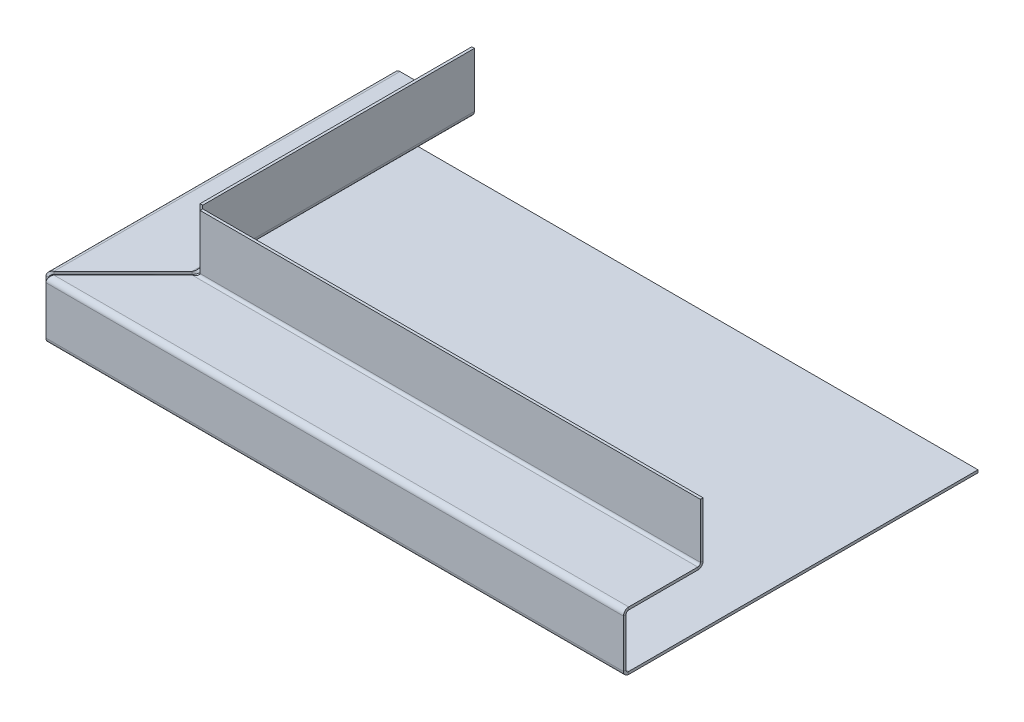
ISO-10303-21;
HEADER;
FILE_DESCRIPTION(('STEP AP214'),'2;1');
FILE_NAME('part.step','',(''),(''),'','','');
FILE_SCHEMA(('AUTOMOTIVE_DESIGN { 1 0 10303 214 1 1 1 1 }'));
ENDSEC;
DATA;
#1=APPLICATION_CONTEXT('core data for automotive mechanical design processes');
#2=APPLICATION_PROTOCOL_DEFINITION('international standard','automotive_design',2000,#1);
#3=PRODUCT_CONTEXT('',#1,'mechanical');
#4=PRODUCT('Part','Part','',(#3));
#5=PRODUCT_RELATED_PRODUCT_CATEGORY('part','',(#4));
#6=PRODUCT_DEFINITION_FORMATION('','',#4);
#7=PRODUCT_DEFINITION_CONTEXT('part definition',#1,'design');
#8=PRODUCT_DEFINITION('design','',#6,#7);
#9=PRODUCT_DEFINITION_SHAPE('','',#8);
#10=(LENGTH_UNIT() NAMED_UNIT(*) SI_UNIT(.MILLI.,.METRE.));
#11=(NAMED_UNIT(*) PLANE_ANGLE_UNIT() SI_UNIT($,.RADIAN.));
#12=(NAMED_UNIT(*) SI_UNIT($,.STERADIAN.) SOLID_ANGLE_UNIT());
#13=UNCERTAINTY_MEASURE_WITH_UNIT(LENGTH_MEASURE(1.E-05),#10,'distance_accuracy_value','');
#14=(GEOMETRIC_REPRESENTATION_CONTEXT(3) GLOBAL_UNCERTAINTY_ASSIGNED_CONTEXT((#13)) GLOBAL_UNIT_ASSIGNED_CONTEXT((#10,
#11,#12)) REPRESENTATION_CONTEXT('',''));
#15=CARTESIAN_POINT('',(0.,0.,0.));
#16=DIRECTION('',(0.,0.,1.));
#17=DIRECTION('',(1.,0.,0.));
#18=AXIS2_PLACEMENT_3D('',#15,#16,#17);
#19=CARTESIAN_POINT('',(83.2879769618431,0.7366,-51.0405807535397));
#20=DIRECTION('',(-1.,0.,0.));
#21=DIRECTION('',(0.,0.,1.));
#22=AXIS2_PLACEMENT_3D('',#19,#20,#21);
#23=PLANE('',#22);
#24=DIRECTION('',(0.,0.,-1.));
#25=VECTOR('',#24,1.);
#26=CARTESIAN_POINT('',(83.2879769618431,0.7366,-51.0405807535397));
#27=LINE('',#26,#25);
#28=CARTESIAN_POINT('',(83.2879769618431,0.7366,46.1504381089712));
#29=VERTEX_POINT('',#28);
#30=CARTESIAN_POINT('',(83.2879769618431,0.7366,-51.0405807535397));
#31=VERTEX_POINT('',#30);
#32=EDGE_CURVE('E56',#29,#31,#27,.T.);
#33=ORIENTED_EDGE('',*,*,#32,.F.);
#34=DIRECTION('',(0.,-1.,0.));
#35=VECTOR('',#34,1.);
#36=CARTESIAN_POINT('',(83.287976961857,0.,46.1504381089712));
#37=LINE('',#36,#35);
#38=CARTESIAN_POINT('',(83.287976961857,0.,46.1504381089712));
#39=VERTEX_POINT('',#38);
#40=EDGE_CURVE('E392',#39,#29,#37,.F.);
#41=ORIENTED_EDGE('',*,*,#40,.F.);
#42=DIRECTION('',(0.,0.,-1.));
#43=VECTOR('',#42,1.);
#44=CARTESIAN_POINT('',(83.2879769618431,0.,-51.0405807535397));
#45=LINE('',#44,#43);
#46=CARTESIAN_POINT('',(83.2879769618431,0.,-51.0405807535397));
#47=VERTEX_POINT('',#46);
#48=EDGE_CURVE('E517',#39,#47,#45,.T.);
#49=ORIENTED_EDGE('',*,*,#48,.T.);
#50=DIRECTION('',(0.,-1.,0.));
#51=VECTOR('',#50,1.);
#52=CARTESIAN_POINT('',(83.2879769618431,0.7366,-51.0405807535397));
#53=LINE('',#52,#51);
#54=EDGE_CURVE('E11',#31,#47,#53,.T.);
#55=ORIENTED_EDGE('',*,*,#54,.F.);
#56=EDGE_LOOP('',(#33,#41,#49,#55));
#57=FACE_BOUND('',#56,.T.);
#58=ADVANCED_FACE('F33',(#57),#23,.F.);
#59=CARTESIAN_POINT('',(-79.0167986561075,0.7366,-51.0405807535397));
#60=DIRECTION('',(0.,0.,1.));
#61=DIRECTION('',(1.,0.,0.));
#62=AXIS2_PLACEMENT_3D('',#59,#60,#61);
#63=PLANE('',#62);
#64=DIRECTION('',(-1.,0.,0.));
#65=VECTOR('',#64,1.);
#66=CARTESIAN_POINT('',(-79.0167986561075,0.,-51.0405807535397));
#67=LINE('',#66,#65);
#68=CARTESIAN_POINT('',(-77.5435986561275,0.,-51.0405807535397));
#69=VERTEX_POINT('',#68);
#70=EDGE_CURVE('E521',#47,#69,#67,.T.);
#71=ORIENTED_EDGE('',*,*,#70,.T.);
#72=DIRECTION('',(0.,-1.,0.));
#73=VECTOR('',#72,1.);
#74=CARTESIAN_POINT('',(-77.5435986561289,0.,-51.0405807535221));
#75=LINE('',#74,#73);
#76=CARTESIAN_POINT('',(-77.5435986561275,0.7366,-51.0405807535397));
#77=VERTEX_POINT('',#76);
#78=EDGE_CURVE('E359',#69,#77,#75,.F.);
#79=ORIENTED_EDGE('',*,*,#78,.T.);
#80=DIRECTION('',(-1.,0.,0.));
#81=VECTOR('',#80,1.);
#82=CARTESIAN_POINT('',(-79.0167986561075,0.7366,-51.0405807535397));
#83=LINE('',#82,#81);
#84=EDGE_CURVE('E40',#31,#77,#83,.T.);
#85=ORIENTED_EDGE('',*,*,#84,.F.);
#86=ORIENTED_EDGE('',*,*,#54,.T.);
#87=EDGE_LOOP('',(#71,#79,#85,#86));
#88=FACE_BOUND('',#87,.T.);
#89=ADVANCED_FACE('F527',(#88),#63,.F.);
#90=CARTESIAN_POINT('',(-79.0167986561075,0.7366,47.6236381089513));
#91=DIRECTION('',(0.,1.,0.));
#92=DIRECTION('',(0.,0.,1.));
#93=AXIS2_PLACEMENT_3D('',#90,#91,#92);
#94=PLANE('',#93);
#95=DIRECTION('',(0.,0.,-1.));
#96=VECTOR('',#95,1.);
#97=CARTESIAN_POINT('',(-77.5435986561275,0.736600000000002,47.6236381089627));
#98=LINE('',#97,#96);
#99=CARTESIAN_POINT('',(-77.5435986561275,0.736600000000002,46.1504381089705));
#100=VERTEX_POINT('',#99);
#101=EDGE_CURVE('E325',#100,#77,#98,.T.);
#102=ORIENTED_EDGE('',*,*,#101,.F.);
#103=DIRECTION('',(-1.,0.,0.));
#104=VECTOR('',#103,1.);
#105=CARTESIAN_POINT('',(894.811855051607,0.736600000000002,46.1504381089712));
#106=LINE('',#105,#104);
#107=EDGE_CURVE('E382',#29,#100,#106,.T.);
#108=ORIENTED_EDGE('',*,*,#107,.F.);
#109=ORIENTED_EDGE('',*,*,#32,.T.);
#110=ORIENTED_EDGE('',*,*,#84,.T.);
#111=EDGE_LOOP('',(#102,#108,#109,#110));
#112=FACE_BOUND('',#111,.T.);
#113=ADVANCED_FACE('F541',(#112),#94,.T.);
#114=CARTESIAN_POINT('',(-79.0167986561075,0.,47.6236381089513));
#115=DIRECTION('',(0.,1.,0.));
#116=DIRECTION('',(0.,0.,1.));
#117=AXIS2_PLACEMENT_3D('',#114,#115,#116);
#118=PLANE('',#117);
#119=DIRECTION('',(-1.,0.,0.));
#120=VECTOR('',#119,1.);
#121=CARTESIAN_POINT('',(894.811855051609,0.,46.1504381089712));
#122=LINE('',#121,#120);
#123=CARTESIAN_POINT('',(-77.5435986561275,0.,46.1504381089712));
#124=VERTEX_POINT('',#123);
#125=EDGE_CURVE('E47',#39,#124,#122,.T.);
#126=ORIENTED_EDGE('',*,*,#125,.T.);
#127=DIRECTION('',(0.,0.,-1.));
#128=VECTOR('',#127,1.);
#129=CARTESIAN_POINT('',(-77.5435986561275,0.,47.6236381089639));
#130=LINE('',#129,#128);
#131=EDGE_CURVE('E362',#124,#69,#130,.T.);
#132=ORIENTED_EDGE('',*,*,#131,.T.);
#133=ORIENTED_EDGE('',*,*,#70,.F.);
#134=ORIENTED_EDGE('',*,*,#48,.F.);
#135=EDGE_LOOP('',(#126,#132,#133,#134));
#136=FACE_BOUND('',#135,.T.);
#137=ADVANCED_FACE('F581',(#136),#118,.F.);
#138=CARTESIAN_POINT('',(83.2879769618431,14.8086901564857,47.6236381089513));
#139=DIRECTION('',(-1.,0.,0.));
#140=DIRECTION('',(0.,1.,-1.49473527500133E-12));
#141=AXIS2_PLACEMENT_3D('',#138,#139,#140);
#142=PLANE('',#141);
#143=DIRECTION('',(0.,1.49473527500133E-12,1.));
#144=VECTOR('',#143,1.);
#145=CARTESIAN_POINT('',(83.2879769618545,1.47320000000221,47.6236381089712));
#146=LINE('',#145,#144);
#147=CARTESIAN_POINT('',(83.2879769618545,1.47320000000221,47.6236381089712));
#148=VERTEX_POINT('',#147);
#149=CARTESIAN_POINT('',(83.2879769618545,1.47320000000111,46.8870381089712));
#150=VERTEX_POINT('',#149);
#151=EDGE_CURVE('E514',#148,#150,#146,.F.);
#152=ORIENTED_EDGE('',*,*,#151,.T.);
#153=DIRECTION('',(0.,1.,-1.49473527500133E-12));
#154=VECTOR('',#153,1.);
#155=CARTESIAN_POINT('',(83.2879769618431,14.8086901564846,46.8870381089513));
#156=LINE('',#155,#154);
#157=CARTESIAN_POINT('',(83.2879769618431,14.8086901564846,46.8870381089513));
#158=VERTEX_POINT('',#157);
#159=EDGE_CURVE('E439',#158,#150,#156,.F.);
#160=ORIENTED_EDGE('',*,*,#159,.F.);
#161=DIRECTION('',(0.,0.,1.));
#162=VECTOR('',#161,1.);
#163=CARTESIAN_POINT('',(83.2879769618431,14.8086901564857,47.6236381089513));
#164=LINE('',#163,#162);
#165=CARTESIAN_POINT('',(83.2879769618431,14.8086901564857,47.6236381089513));
#166=VERTEX_POINT('',#165);
#167=EDGE_CURVE('E511',#166,#158,#164,.F.);
#168=ORIENTED_EDGE('',*,*,#167,.F.);
#169=DIRECTION('',(0.,1.,-1.49473527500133E-12));
#170=VECTOR('',#169,1.);
#171=CARTESIAN_POINT('',(83.2879769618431,14.8086901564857,47.6236381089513));
#172=LINE('',#171,#170);
#173=EDGE_CURVE('E479',#166,#148,#172,.F.);
#174=ORIENTED_EDGE('',*,*,#173,.T.);
#175=EDGE_LOOP('',(#152,#160,#168,#174));
#176=FACE_BOUND('',#175,.T.);
#177=ADVANCED_FACE('F585',(#176),#142,.F.);
#178=CARTESIAN_POINT('',(83.2879769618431,14.8086901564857,46.1504381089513));
#179=DIRECTION('',(1.,0.,0.));
#180=DIRECTION('',(0.,0.,-1.));
#181=AXIS2_PLACEMENT_3D('',#178,#179,#180);
#182=PLANE('',#181);
#183=ORIENTED_EDGE('',*,*,#167,.T.);
#184=CARTESIAN_POINT('',(83.2879769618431,14.8086901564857,46.1504381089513));
#185=DIRECTION('',(-1.,0.,0.));
#186=DIRECTION('',(0.,0.,1.));
#187=AXIS2_PLACEMENT_3D('',#184,#185,#186);
#188=CIRCLE('',#187,0.7366);
#189=CARTESIAN_POINT('',(83.2879769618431,15.5452901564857,46.1504381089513));
#190=VERTEX_POINT('',#189);
#191=EDGE_CURVE('E400',#158,#190,#188,.T.);
#192=ORIENTED_EDGE('',*,*,#191,.T.);
#193=DIRECTION('',(0.,1.,0.));
#194=VECTOR('',#193,1.);
#195=CARTESIAN_POINT('',(83.2879769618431,16.2818901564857,46.1504381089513));
#196=LINE('',#195,#194);
#197=CARTESIAN_POINT('',(83.2879769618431,16.2818901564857,46.1504381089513));
#198=VERTEX_POINT('',#197);
#199=EDGE_CURVE('E508',#198,#190,#196,.F.);
#200=ORIENTED_EDGE('',*,*,#199,.F.);
#201=CARTESIAN_POINT('',(83.2879769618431,14.8086901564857,46.1504381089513));
#202=DIRECTION('',(-1.,0.,0.));
#203=DIRECTION('',(0.,0.,1.));
#204=AXIS2_PLACEMENT_3D('',#201,#202,#203);
#205=CIRCLE('',#204,1.4732);
#206=EDGE_CURVE('E444',#166,#198,#205,.T.);
#207=ORIENTED_EDGE('',*,*,#206,.F.);
#208=EDGE_LOOP('',(#183,#192,#200,#207));
#209=FACE_BOUND('',#208,.T.);
#210=ADVANCED_FACE('F589',(#209),#182,.T.);
#211=CARTESIAN_POINT('',(83.2879769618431,16.2818901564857,47.6236381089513));
#212=DIRECTION('',(-1.,0.,0.));
#213=DIRECTION('',(0.,0.,1.));
#214=AXIS2_PLACEMENT_3D('',#211,#212,#213);
#215=PLANE('',#214);
#216=ORIENTED_EDGE('',*,*,#199,.T.);
#217=DIRECTION('',(0.,0.,1.));
#218=VECTOR('',#217,1.);
#219=CARTESIAN_POINT('',(83.2879769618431,15.5452901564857,47.6236381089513));
#220=LINE('',#219,#218);
#221=CARTESIAN_POINT('',(83.2879769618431,15.5452901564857,26.9253958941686));
#222=VERTEX_POINT('',#221);
#223=EDGE_CURVE('E401',#190,#222,#220,.F.);
#224=ORIENTED_EDGE('',*,*,#223,.T.);
#225=DIRECTION('',(0.,1.,0.));
#226=VECTOR('',#225,1.);
#227=CARTESIAN_POINT('',(83.2879769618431,16.2818901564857,26.9253958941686));
#228=LINE('',#227,#226);
#229=CARTESIAN_POINT('',(83.2879769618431,16.2818901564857,26.9253958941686));
#230=VERTEX_POINT('',#229);
#231=EDGE_CURVE('E505',#230,#222,#228,.F.);
#232=ORIENTED_EDGE('',*,*,#231,.F.);
#233=DIRECTION('',(0.,0.,1.));
#234=VECTOR('',#233,1.);
#235=CARTESIAN_POINT('',(83.2879769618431,16.2818901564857,47.6236381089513));
#236=LINE('',#235,#234);
#237=EDGE_CURVE('E445',#198,#230,#236,.F.);
#238=ORIENTED_EDGE('',*,*,#237,.F.);
#239=EDGE_LOOP('',(#216,#224,#232,#238));
#240=FACE_BOUND('',#239,.T.);
#241=ADVANCED_FACE('F593',(#240),#215,.F.);
#242=CARTESIAN_POINT('',(83.2879769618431,17.0184901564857,26.9253958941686));
#243=DIRECTION('',(1.,0.,0.));
#244=DIRECTION('',(0.,0.,-1.));
#245=AXIS2_PLACEMENT_3D('',#242,#243,#244);
#246=PLANE('',#245);
#247=ORIENTED_EDGE('',*,*,#231,.T.);
#248=CARTESIAN_POINT('',(83.2879769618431,17.0184901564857,26.9253958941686));
#249=DIRECTION('',(-1.,0.,0.));
#250=DIRECTION('',(0.,0.,1.));
#251=AXIS2_PLACEMENT_3D('',#248,#249,#250);
#252=CIRCLE('',#251,1.4732);
#253=CARTESIAN_POINT('',(83.2879769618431,17.0184901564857,25.4521958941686));
#254=VERTEX_POINT('',#253);
#255=EDGE_CURVE('E404',#222,#254,#252,.F.);
#256=ORIENTED_EDGE('',*,*,#255,.T.);
#257=DIRECTION('',(0.,0.,1.));
#258=VECTOR('',#257,1.);
#259=CARTESIAN_POINT('',(83.2879769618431,17.0184901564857,26.1887958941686));
#260=LINE('',#259,#258);
#261=CARTESIAN_POINT('',(83.2879769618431,17.0184901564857,26.1887958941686));
#262=VERTEX_POINT('',#261);
#263=EDGE_CURVE('E502',#262,#254,#260,.F.);
#264=ORIENTED_EDGE('',*,*,#263,.F.);
#265=CARTESIAN_POINT('',(83.2879769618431,17.0184901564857,26.9253958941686));
#266=DIRECTION('',(-1.,0.,0.));
#267=DIRECTION('',(0.,0.,1.));
#268=AXIS2_PLACEMENT_3D('',#265,#266,#267);
#269=CIRCLE('',#268,0.7366);
#270=EDGE_CURVE('E448',#230,#262,#269,.F.);
#271=ORIENTED_EDGE('',*,*,#270,.F.);
#272=EDGE_LOOP('',(#247,#256,#264,#271));
#273=FACE_BOUND('',#272,.T.);
#274=ADVANCED_FACE('F597',(#273),#246,.T.);
#275=CARTESIAN_POINT('',(83.2879769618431,16.2818901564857,26.1887958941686));
#276=DIRECTION('',(1.,0.,0.));
#277=DIRECTION('',(0.,1.,0.));
#278=AXIS2_PLACEMENT_3D('',#275,#276,#277);
#279=PLANE('',#278);
#280=ORIENTED_EDGE('',*,*,#263,.T.);
#281=DIRECTION('',(0.,1.,0.));
#282=VECTOR('',#281,1.);
#283=CARTESIAN_POINT('',(83.2879769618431,16.2818901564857,25.4521958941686));
#284=LINE('',#283,#282);
#285=CARTESIAN_POINT('',(83.2879769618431,32.2257774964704,25.4521958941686));
#286=VERTEX_POINT('',#285);
#287=EDGE_CURVE('E410',#254,#286,#284,.T.);
#288=ORIENTED_EDGE('',*,*,#287,.T.);
#289=DIRECTION('',(0.,0.,1.));
#290=VECTOR('',#289,1.);
#291=CARTESIAN_POINT('',(83.2879769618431,32.2257774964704,26.1887958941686));
#292=LINE('',#291,#290);
#293=CARTESIAN_POINT('',(83.2879769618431,32.2257774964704,26.1887958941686));
#294=VERTEX_POINT('',#293);
#295=EDGE_CURVE('E499',#294,#286,#292,.F.);
#296=ORIENTED_EDGE('',*,*,#295,.F.);
#297=DIRECTION('',(0.,1.,0.));
#298=VECTOR('',#297,1.);
#299=CARTESIAN_POINT('',(83.2879769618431,16.2818901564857,26.1887958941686));
#300=LINE('',#299,#298);
#301=EDGE_CURVE('E453',#262,#294,#300,.T.);
#302=ORIENTED_EDGE('',*,*,#301,.F.);
#303=EDGE_LOOP('',(#280,#288,#296,#302));
#304=FACE_BOUND('',#303,.T.);
#305=ADVANCED_FACE('F601',(#304),#279,.T.);
#306=CARTESIAN_POINT('',(83.2879769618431,32.2257774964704,26.1887958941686));
#307=DIRECTION('',(0.,-1.,0.));
#308=DIRECTION('',(1.,0.,0.));
#309=AXIS2_PLACEMENT_3D('',#306,#307,#308);
#310=PLANE('',#309);
#311=ORIENTED_EDGE('',*,*,#295,.T.);
#312=DIRECTION('',(1.,0.,0.));
#313=VECTOR('',#312,1.);
#314=CARTESIAN_POINT('',(83.2879769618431,32.2257774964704,25.4521958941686));
#315=LINE('',#314,#313);
#316=CARTESIAN_POINT('',(-55.9473308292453,32.2257774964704,25.4521958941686));
#317=VERTEX_POINT('',#316);
#318=EDGE_CURVE('E407',#286,#317,#315,.F.);
#319=ORIENTED_EDGE('',*,*,#318,.T.);
#320=DIRECTION('',(0.,0.,1.));
#321=VECTOR('',#320,1.);
#322=CARTESIAN_POINT('',(-55.9473308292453,32.2257774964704,26.1887958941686));
#323=LINE('',#322,#321);
#324=CARTESIAN_POINT('',(-55.9473308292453,32.2257774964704,26.1887958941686));
#325=VERTEX_POINT('',#324);
#326=EDGE_CURVE('E496',#325,#317,#323,.F.);
#327=ORIENTED_EDGE('',*,*,#326,.F.);
#328=DIRECTION('',(1.,0.,0.));
#329=VECTOR('',#328,1.);
#330=CARTESIAN_POINT('',(83.2879769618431,32.2257774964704,26.1887958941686));
#331=LINE('',#330,#329);
#332=EDGE_CURVE('E451',#294,#325,#331,.F.);
#333=ORIENTED_EDGE('',*,*,#332,.F.);
#334=EDGE_LOOP('',(#311,#319,#327,#333));
#335=FACE_BOUND('',#334,.T.);
#336=ADVANCED_FACE('F605',(#335),#310,.F.);
#337=CARTESIAN_POINT('',(-55.9473308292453,16.2818901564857,26.1887958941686));
#338=DIRECTION('',(1.,0.,0.));
#339=DIRECTION('',(0.,1.,0.));
#340=AXIS2_PLACEMENT_3D('',#337,#338,#339);
#341=PLANE('',#340);
#342=ORIENTED_EDGE('',*,*,#326,.T.);
#343=DIRECTION('',(0.,1.,0.));
#344=VECTOR('',#343,1.);
#345=CARTESIAN_POINT('',(-55.9473308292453,16.2818901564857,25.4521958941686));
#346=LINE('',#345,#344);
#347=CARTESIAN_POINT('',(-55.9473308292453,17.0184901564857,25.4521958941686));
#348=VERTEX_POINT('',#347);
#349=EDGE_CURVE('E423',#317,#348,#346,.F.);
#350=ORIENTED_EDGE('',*,*,#349,.T.);
#351=DIRECTION('',(0.,0.,1.));
#352=VECTOR('',#351,1.);
#353=CARTESIAN_POINT('',(-55.9473308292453,17.0184901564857,26.1887958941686));
#354=LINE('',#353,#352);
#355=CARTESIAN_POINT('',(-55.9473308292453,17.0184901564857,26.1887958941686));
#356=VERTEX_POINT('',#355);
#357=EDGE_CURVE('E493',#356,#348,#354,.F.);
#358=ORIENTED_EDGE('',*,*,#357,.F.);
#359=DIRECTION('',(0.,1.,0.));
#360=VECTOR('',#359,1.);
#361=CARTESIAN_POINT('',(-55.9473308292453,16.2818901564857,26.1887958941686));
#362=LINE('',#361,#360);
#363=EDGE_CURVE('E463',#325,#356,#362,.F.);
#364=ORIENTED_EDGE('',*,*,#363,.F.);
#365=EDGE_LOOP('',(#342,#350,#358,#364));
#366=FACE_BOUND('',#365,.T.);
#367=ADVANCED_FACE('F609',(#366),#341,.F.);
#368=CARTESIAN_POINT('',(-58.8937308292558,17.0184901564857,27.6619958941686));
#369=CARTESIAN_POINT('',(-58.8937308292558,17.0184901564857,27.907529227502));
#370=CARTESIAN_POINT('',(-58.8937308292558,17.0184901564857,28.1530625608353));
#371=CARTESIAN_POINT('',(-58.8937308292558,17.0184901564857,28.3985958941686));
#372=CARTESIAN_POINT('',(-58.8937308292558,18.4916901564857,27.6619958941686));
#373=CARTESIAN_POINT('',(-58.8937308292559,18.9827568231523,27.907529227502));
#374=CARTESIAN_POINT('',(-58.8937308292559,19.473823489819,28.1530625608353));
#375=CARTESIAN_POINT('',(-58.8937308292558,19.9648901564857,28.3985958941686));
#376=CARTESIAN_POINT('',(-55.9473308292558,18.4916901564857,26.1887958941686));
#377=CARTESIAN_POINT('',(-55.9473308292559,18.9827568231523,25.9432625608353));
#378=CARTESIAN_POINT('',(-55.9473308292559,19.473823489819,25.697729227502));
#379=CARTESIAN_POINT('',(-55.9473308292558,19.9648901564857,25.4521958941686));
#380=CARTESIAN_POINT('',(-55.9473308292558,17.0184901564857,26.1887958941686));
#381=CARTESIAN_POINT('',(-55.9473308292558,17.0184901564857,25.9432625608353));
#382=CARTESIAN_POINT('',(-55.9473308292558,17.0184901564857,25.697729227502));
#383=CARTESIAN_POINT('',(-55.9473308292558,17.0184901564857,25.4521958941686));
#384=CARTESIAN_POINT('',(-55.9473308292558,15.5452901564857,26.1887958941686));
#385=CARTESIAN_POINT('',(-55.9473308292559,15.054223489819,25.9432625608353));
#386=CARTESIAN_POINT('',(-55.9473308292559,14.5631568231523,25.697729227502));
#387=CARTESIAN_POINT('',(-55.9473308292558,14.0720901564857,25.4521958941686));
#388=CARTESIAN_POINT('',(-58.8937308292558,15.5452901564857,27.6619958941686));
#389=CARTESIAN_POINT('',(-58.8937308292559,15.054223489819,27.907529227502));
#390=CARTESIAN_POINT('',(-58.8937308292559,14.5631568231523,28.1530625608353));
#391=CARTESIAN_POINT('',(-58.8937308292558,14.0720901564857,28.3985958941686));
#392=CARTESIAN_POINT('',(-58.8937308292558,17.0184901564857,27.6619958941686));
#393=CARTESIAN_POINT('',(-58.8937308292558,17.0184901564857,27.907529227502));
#394=CARTESIAN_POINT('',(-58.8937308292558,17.0184901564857,28.1530625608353));
#395=CARTESIAN_POINT('',(-58.8937308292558,17.0184901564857,28.3985958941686));
#396=(BOUNDED_SURFACE() B_SPLINE_SURFACE(3,3,((#368,#369,#370,#371),(#372,#373,#374,#375),(#376,
#377,#378,#379),(#380,#381,#382,#383),(#384,#385,#386,#387),(#388,#389,#390,#391),(#392,#393,
#394,#395)),.UNSPECIFIED.,.T.,.F.,.F.) B_SPLINE_SURFACE_WITH_KNOTS((4,3,4),(4,4),(0.,0.5,1.),
(0.,1.),.UNSPECIFIED.) GEOMETRIC_REPRESENTATION_ITEM() RATIONAL_B_SPLINE_SURFACE(((1.,1.,1.,1.),
(0.333333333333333,0.333333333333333,0.333333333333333,0.333333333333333),(0.333333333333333,
0.333333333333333,0.333333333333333,0.333333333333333),(1.,1.,1.,1.),(0.333333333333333,
0.333333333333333,0.333333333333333,0.333333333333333),(0.333333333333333,0.333333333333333,
0.333333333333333,0.333333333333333),(1.,1.,1.,1.))) REPRESENTATION_ITEM('') SURFACE());
#397=CARTESIAN_POINT('',(-57.4205308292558,17.0184901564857,26.9253958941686));
#398=DIRECTION('',(-0.707106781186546,0.,-0.707106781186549));
#399=DIRECTION('',(-0.707106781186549,0.,0.707106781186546));
#400=AXIS2_PLACEMENT_3D('',#397,#398,#399);
#401=ELLIPSE('',#400,2.08341942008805,1.4732);
#402=CARTESIAN_POINT('',(-57.4205308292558,15.5452901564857,26.9253958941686));
#403=VERTEX_POINT('',#402);
#404=EDGE_CURVE('E419',#348,#403,#401,.T.);
#405=DIRECTION('',(0.,1.,0.));
#406=VECTOR('',#405,1.);
#407=CARTESIAN_POINT('',(-57.4205308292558,16.2818901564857,26.9253958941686));
#408=LINE('',#407,#406);
#409=CARTESIAN_POINT('',(-57.4205308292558,16.2818901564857,26.9253958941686));
#410=VERTEX_POINT('',#409);
#411=EDGE_CURVE('E490',#410,#403,#408,.F.);
#412=CARTESIAN_POINT('',(-57.4205308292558,17.0184901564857,26.9253958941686));
#413=DIRECTION('',(-0.447213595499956,0.,-0.894427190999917));
#414=DIRECTION('',(-0.894427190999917,0.,0.447213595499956));
#415=AXIS2_PLACEMENT_3D('',#412,#413,#414);
#416=ELLIPSE('',#415,1.64708767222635,0.7366);
#417=EDGE_CURVE('E459',#356,#410,#416,.T.);
#418=ORIENTED_EDGE('',*,*,#357,.T.);
#419=ORIENTED_EDGE('',*,*,#404,.T.);
#420=ORIENTED_EDGE('',*,*,#411,.F.);
#421=ORIENTED_EDGE('',*,*,#417,.F.);
#422=EDGE_LOOP('',(#418,#419,#420,#421));
#423=FACE_BOUND('',#422,.T.);
#424=ADVANCED_FACE('F613',(#423),#396,.F.);
#425=CARTESIAN_POINT('',(2.58460195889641,16.2818901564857,-33.0797368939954));
#426=DIRECTION('',(-0.707106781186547,0.,-0.707106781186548));
#427=DIRECTION('',(-0.707106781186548,0.,0.707106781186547));
#428=AXIS2_PLACEMENT_3D('',#425,#426,#427);
#429=PLANE('',#428);
#430=ORIENTED_EDGE('',*,*,#411,.T.);
#431=DIRECTION('',(-0.707106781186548,0.,0.707106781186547));
#432=VECTOR('',#431,1.);
#433=CARTESIAN_POINT('',(2.58460195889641,15.5452901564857,-33.0797368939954));
#434=LINE('',#433,#432);
#435=CARTESIAN_POINT('',(-76.6455730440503,15.5452901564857,46.1504381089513));
#436=VERTEX_POINT('',#435);
#437=EDGE_CURVE('E420',#403,#436,#434,.T.);
#438=ORIENTED_EDGE('',*,*,#437,.T.);
#439=DIRECTION('',(0.,1.,0.));
#440=VECTOR('',#439,1.);
#441=CARTESIAN_POINT('',(-76.6455730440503,16.2818901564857,46.1504381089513));
#442=LINE('',#441,#440);
#443=CARTESIAN_POINT('',(-76.6455730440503,16.2818901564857,46.1504381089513));
#444=VERTEX_POINT('',#443);
#445=EDGE_CURVE('E487',#444,#436,#442,.F.);
#446=ORIENTED_EDGE('',*,*,#445,.F.);
#447=DIRECTION('',(-0.707106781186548,0.,0.707106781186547));
#448=VECTOR('',#447,1.);
#449=CARTESIAN_POINT('',(2.58460195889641,16.2818901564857,-33.0797368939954));
#450=LINE('',#449,#448);
#451=EDGE_CURVE('E460',#410,#444,#450,.T.);
#452=ORIENTED_EDGE('',*,*,#451,.F.);
#453=EDGE_LOOP('',(#430,#438,#446,#452));
#454=FACE_BOUND('',#453,.T.);
#455=ADVANCED_FACE('F619',(#454),#429,.T.);
#456=CARTESIAN_POINT('',(-77.3821730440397,14.8086901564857,47.6236381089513));
#457=CARTESIAN_POINT('',(-77.3821730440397,14.8086901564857,47.3781047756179));
#458=CARTESIAN_POINT('',(-77.3821730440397,14.8086901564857,47.1325714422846));
#459=CARTESIAN_POINT('',(-77.3821730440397,14.8086901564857,46.8870381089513));
#460=CARTESIAN_POINT('',(-77.3821730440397,11.8622901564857,47.6236381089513));
#461=CARTESIAN_POINT('',(-77.3821730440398,12.3533568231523,47.378104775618));
#462=CARTESIAN_POINT('',(-77.3821730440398,12.844423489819,47.1325714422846));
#463=CARTESIAN_POINT('',(-77.3821730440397,13.3354901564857,46.8870381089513));
#464=CARTESIAN_POINT('',(-75.9089730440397,11.8622901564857,44.6772381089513));
#465=CARTESIAN_POINT('',(-75.9089730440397,12.3533568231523,44.9227714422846));
#466=CARTESIAN_POINT('',(-75.9089730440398,12.844423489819,45.168304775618));
#467=CARTESIAN_POINT('',(-75.9089730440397,13.3354901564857,45.4138381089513));
#468=CARTESIAN_POINT('',(-75.9089730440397,14.8086901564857,44.6772381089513));
#469=CARTESIAN_POINT('',(-75.9089730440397,14.8086901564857,44.9227714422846));
#470=CARTESIAN_POINT('',(-75.9089730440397,14.8086901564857,45.1683047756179));
#471=CARTESIAN_POINT('',(-75.9089730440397,14.8086901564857,45.4138381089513));
#472=CARTESIAN_POINT('',(-75.9089730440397,17.7550901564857,44.6772381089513));
#473=CARTESIAN_POINT('',(-75.9089730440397,17.264023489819,44.9227714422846));
#474=CARTESIAN_POINT('',(-75.9089730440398,16.7729568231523,45.168304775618));
#475=CARTESIAN_POINT('',(-75.9089730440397,16.2818901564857,45.4138381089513));
#476=CARTESIAN_POINT('',(-77.3821730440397,17.7550901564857,47.6236381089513));
#477=CARTESIAN_POINT('',(-77.3821730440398,17.264023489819,47.378104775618));
#478=CARTESIAN_POINT('',(-77.3821730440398,16.7729568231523,47.1325714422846));
#479=CARTESIAN_POINT('',(-77.3821730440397,16.2818901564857,46.8870381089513));
#480=CARTESIAN_POINT('',(-77.3821730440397,14.8086901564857,47.6236381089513));
#481=CARTESIAN_POINT('',(-77.3821730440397,14.8086901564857,47.3781047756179));
#482=CARTESIAN_POINT('',(-77.3821730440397,14.8086901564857,47.1325714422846));
#483=CARTESIAN_POINT('',(-77.3821730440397,14.8086901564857,46.8870381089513));
#484=(BOUNDED_SURFACE() B_SPLINE_SURFACE(3,3,((#456,#457,#458,#459),(#460,#461,#462,#463),(#464,
#465,#466,#467),(#468,#469,#470,#471),(#472,#473,#474,#475),(#476,#477,#478,#479),(#480,#481,
#482,#483)),.UNSPECIFIED.,.T.,.F.,.F.) B_SPLINE_SURFACE_WITH_KNOTS((4,3,4),(4,4),(0.,0.5,1.),
(0.,1.),.UNSPECIFIED.) GEOMETRIC_REPRESENTATION_ITEM() RATIONAL_B_SPLINE_SURFACE(((1.,1.,1.,1.),
(0.333333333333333,0.333333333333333,0.333333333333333,0.333333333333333),(0.333333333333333,
0.333333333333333,0.333333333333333,0.333333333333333),(1.,1.,1.,1.),(0.333333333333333,
0.333333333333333,0.333333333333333,0.333333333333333),(0.333333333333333,0.333333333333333,
0.333333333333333,0.333333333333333),(1.,1.,1.,1.))) REPRESENTATION_ITEM('') SURFACE());
#485=CARTESIAN_POINT('',(-76.6455730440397,14.8086901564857,46.1504381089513));
#486=DIRECTION('',(-0.707106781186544,0.,-0.707106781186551));
#487=DIRECTION('',(-0.707106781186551,0.,0.707106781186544));
#488=AXIS2_PLACEMENT_3D('',#485,#486,#487);
#489=ELLIPSE('',#488,1.04170971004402,0.7366);
#490=CARTESIAN_POINT('',(-77.3821730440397,14.8086901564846,46.8870381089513));
#491=VERTEX_POINT('',#490);
#492=EDGE_CURVE('E416',#436,#491,#489,.F.);
#493=DIRECTION('',(0.,1.49473527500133E-12,1.));
#494=VECTOR('',#493,1.);
#495=CARTESIAN_POINT('',(-77.3821730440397,14.8086901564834,47.6236381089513));
#496=LINE('',#495,#494);
#497=CARTESIAN_POINT('',(-77.3821730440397,14.8086901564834,47.6236381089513));
#498=VERTEX_POINT('',#497);
#499=EDGE_CURVE('E484',#498,#491,#496,.F.);
#500=CARTESIAN_POINT('',(-76.6455730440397,14.8086901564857,46.1504381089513));
#501=DIRECTION('',(-0.894427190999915,0.,-0.44721359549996));
#502=DIRECTION('',(-0.44721359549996,0.,0.894427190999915));
#503=AXIS2_PLACEMENT_3D('',#500,#501,#502);
#504=ELLIPSE('',#503,1.64708767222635,1.4732);
#505=EDGE_CURVE('E456',#444,#498,#504,.F.);
#506=ORIENTED_EDGE('',*,*,#445,.T.);
#507=ORIENTED_EDGE('',*,*,#492,.T.);
#508=ORIENTED_EDGE('',*,*,#499,.F.);
#509=ORIENTED_EDGE('',*,*,#505,.F.);
#510=EDGE_LOOP('',(#506,#507,#508,#509));
#511=FACE_BOUND('',#510,.T.);
#512=ADVANCED_FACE('F628',(#511),#484,.F.);
#513=CARTESIAN_POINT('',(-77.3821730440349,14.8086901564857,47.6236381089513));
#514=DIRECTION('',(-1.,0.,0.));
#515=DIRECTION('',(0.,1.,-1.49473527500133E-12));
#516=AXIS2_PLACEMENT_3D('',#513,#514,#515);
#517=PLANE('',#516);
#518=ORIENTED_EDGE('',*,*,#499,.T.);
#519=DIRECTION('',(0.,1.,-1.49473527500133E-12));
#520=VECTOR('',#519,1.);
#521=CARTESIAN_POINT('',(-77.3821730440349,14.8086901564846,46.8870381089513));
#522=LINE('',#521,#520);
#523=CARTESIAN_POINT('',(-77.3821730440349,1.47320000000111,46.8870381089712));
#524=VERTEX_POINT('',#523);
#525=EDGE_CURVE('E412',#524,#491,#522,.T.);
#526=ORIENTED_EDGE('',*,*,#525,.F.);
#527=DIRECTION('',(0.,1.49473527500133E-12,1.));
#528=VECTOR('',#527,1.);
#529=CARTESIAN_POINT('',(-77.3821730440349,1.47320000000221,47.6236381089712));
#530=LINE('',#529,#528);
#531=CARTESIAN_POINT('',(-77.3821730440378,1.47320000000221,47.6236381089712));
#532=VERTEX_POINT('',#531);
#533=EDGE_CURVE('E415',#532,#524,#530,.F.);
#534=ORIENTED_EDGE('',*,*,#533,.F.);
#535=DIRECTION('',(0.,1.,-1.49473527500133E-12));
#536=VECTOR('',#535,1.);
#537=CARTESIAN_POINT('',(-77.3821730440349,14.8086901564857,47.6236381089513));
#538=LINE('',#537,#536);
#539=EDGE_CURVE('E411',#532,#498,#538,.T.);
#540=ORIENTED_EDGE('',*,*,#539,.T.);
#541=EDGE_LOOP('',(#518,#526,#534,#540));
#542=FACE_BOUND('',#541,.T.);
#543=ADVANCED_FACE('F634',(#542),#517,.T.);
#544=CARTESIAN_POINT('',(83.2879769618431,14.8086901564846,46.8870381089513));
#545=DIRECTION('',(0.,-1.49473527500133E-12,-1.));
#546=DIRECTION('',(0.,1.,-1.49473527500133E-12));
#547=AXIS2_PLACEMENT_3D('',#544,#545,#546);
#548=PLANE('',#547);
#549=ORIENTED_EDGE('',*,*,#525,.T.);
#550=DIRECTION('',(1.,0.,0.));
#551=VECTOR('',#550,1.);
#552=CARTESIAN_POINT('',(83.2879769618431,14.8086901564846,46.8870381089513));
#553=LINE('',#552,#551);
#554=EDGE_CURVE('E398',#158,#491,#553,.F.);
#555=ORIENTED_EDGE('',*,*,#554,.F.);
#556=ORIENTED_EDGE('',*,*,#159,.T.);
#557=DIRECTION('',(1.,0.,0.));
#558=VECTOR('',#557,1.);
#559=CARTESIAN_POINT('',(83.2879769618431,1.47320000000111,46.8870381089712));
#560=LINE('',#559,#558);
#561=EDGE_CURVE('E424',#150,#524,#560,.F.);
#562=ORIENTED_EDGE('',*,*,#561,.T.);
#563=EDGE_LOOP('',(#549,#555,#556,#562));
#564=FACE_BOUND('',#563,.T.);
#565=ADVANCED_FACE('F643',(#564),#548,.T.);
#566=CARTESIAN_POINT('',(83.2879769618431,14.8086901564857,46.1504381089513));
#567=DIRECTION('',(-1.,0.,0.));
#568=DIRECTION('',(0.,0.,1.));
#569=AXIS2_PLACEMENT_3D('',#566,#567,#568);
#570=CYLINDRICAL_SURFACE('',#569,0.7366);
#571=DIRECTION('',(-1.,0.,0.));
#572=VECTOR('',#571,1.);
#573=CARTESIAN_POINT('',(83.2879769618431,15.5452901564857,46.1504381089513));
#574=LINE('',#573,#572);
#575=EDGE_CURVE('E402',#190,#436,#574,.T.);
#576=ORIENTED_EDGE('',*,*,#575,.F.);
#577=ORIENTED_EDGE('',*,*,#191,.F.);
#578=ORIENTED_EDGE('',*,*,#554,.T.);
#579=ORIENTED_EDGE('',*,*,#492,.F.);
#580=EDGE_LOOP('',(#576,#577,#578,#579));
#581=FACE_BOUND('',#580,.T.);
#582=ADVANCED_FACE('F676',(#581),#570,.F.);
#583=CARTESIAN_POINT('',(83.2879769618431,17.0184901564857,26.9253958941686));
#584=DIRECTION('',(-1.,0.,0.));
#585=DIRECTION('',(0.,0.,1.));
#586=AXIS2_PLACEMENT_3D('',#583,#584,#585);
#587=CYLINDRICAL_SURFACE('',#586,1.4732);
#588=DIRECTION('',(-1.,0.,0.));
#589=VECTOR('',#588,1.);
#590=CARTESIAN_POINT('',(83.2879769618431,17.0184901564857,25.4521958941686));
#591=LINE('',#590,#589);
#592=EDGE_CURVE('E408',#254,#348,#591,.T.);
#593=ORIENTED_EDGE('',*,*,#592,.F.);
#594=ORIENTED_EDGE('',*,*,#255,.F.);
#595=DIRECTION('',(1.,0.,0.));
#596=VECTOR('',#595,1.);
#597=CARTESIAN_POINT('',(83.2879769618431,15.5452901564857,26.9253958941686));
#598=LINE('',#597,#596);
#599=EDGE_CURVE('E405',#222,#403,#598,.F.);
#600=ORIENTED_EDGE('',*,*,#599,.T.);
#601=ORIENTED_EDGE('',*,*,#404,.F.);
#602=EDGE_LOOP('',(#593,#594,#600,#601));
#603=FACE_BOUND('',#602,.T.);
#604=ADVANCED_FACE('F672',(#603),#587,.T.);
#605=CARTESIAN_POINT('',(83.2879769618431,16.2818901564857,25.4521958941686));
#606=DIRECTION('',(0.,0.,1.));
#607=DIRECTION('',(1.,0.,0.));
#608=AXIS2_PLACEMENT_3D('',#605,#606,#607);
#609=PLANE('',#608);
#610=ORIENTED_EDGE('',*,*,#318,.F.);
#611=ORIENTED_EDGE('',*,*,#287,.F.);
#612=ORIENTED_EDGE('',*,*,#592,.T.);
#613=ORIENTED_EDGE('',*,*,#349,.F.);
#614=EDGE_LOOP('',(#610,#611,#612,#613));
#615=FACE_BOUND('',#614,.T.);
#616=ADVANCED_FACE('F668',(#615),#609,.F.);
#617=CARTESIAN_POINT('',(83.2879769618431,15.5452901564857,47.6236381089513));
#618=DIRECTION('',(0.,1.,0.));
#619=DIRECTION('',(0.,0.,1.));
#620=AXIS2_PLACEMENT_3D('',#617,#618,#619);
#621=PLANE('',#620);
#622=ORIENTED_EDGE('',*,*,#599,.F.);
#623=ORIENTED_EDGE('',*,*,#223,.F.);
#624=ORIENTED_EDGE('',*,*,#575,.T.);
#625=ORIENTED_EDGE('',*,*,#437,.F.);
#626=EDGE_LOOP('',(#622,#623,#624,#625));
#627=FACE_BOUND('',#626,.T.);
#628=ADVANCED_FACE('F664',(#627),#621,.F.);
#629=CARTESIAN_POINT('',(83.2879769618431,14.8086901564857,47.6236381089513));
#630=DIRECTION('',(0.,-1.49473527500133E-12,-1.));
#631=DIRECTION('',(0.,1.,-1.49473527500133E-12));
#632=AXIS2_PLACEMENT_3D('',#629,#630,#631);
#633=PLANE('',#632);
#634=ORIENTED_EDGE('',*,*,#539,.F.);
#635=DIRECTION('',(1.,0.,0.));
#636=VECTOR('',#635,1.);
#637=CARTESIAN_POINT('',(83.2879769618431,1.47320000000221,47.6236381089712));
#638=LINE('',#637,#636);
#639=EDGE_CURVE('E464',#148,#532,#638,.F.);
#640=ORIENTED_EDGE('',*,*,#639,.F.);
#641=ORIENTED_EDGE('',*,*,#173,.F.);
#642=DIRECTION('',(1.,0.,0.));
#643=VECTOR('',#642,1.);
#644=CARTESIAN_POINT('',(83.2879769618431,14.8086901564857,47.6236381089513));
#645=LINE('',#644,#643);
#646=EDGE_CURVE('E442',#166,#498,#645,.F.);
#647=ORIENTED_EDGE('',*,*,#646,.T.);
#648=EDGE_LOOP('',(#634,#640,#641,#647));
#649=FACE_BOUND('',#648,.T.);
#650=ADVANCED_FACE('F660',(#649),#633,.F.);
#651=CARTESIAN_POINT('',(83.2879769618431,14.8086901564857,46.1504381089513));
#652=DIRECTION('',(-1.,0.,0.));
#653=DIRECTION('',(0.,0.,1.));
#654=AXIS2_PLACEMENT_3D('',#651,#652,#653);
#655=CYLINDRICAL_SURFACE('',#654,1.4732);
#656=DIRECTION('',(-1.,0.,0.));
#657=VECTOR('',#656,1.);
#658=CARTESIAN_POINT('',(83.2879769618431,16.2818901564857,46.1504381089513));
#659=LINE('',#658,#657);
#660=EDGE_CURVE('E446',#198,#444,#659,.T.);
#661=ORIENTED_EDGE('',*,*,#660,.T.);
#662=ORIENTED_EDGE('',*,*,#505,.T.);
#663=ORIENTED_EDGE('',*,*,#646,.F.);
#664=ORIENTED_EDGE('',*,*,#206,.T.);
#665=EDGE_LOOP('',(#661,#662,#663,#664));
#666=FACE_BOUND('',#665,.T.);
#667=ADVANCED_FACE('F656',(#666),#655,.T.);
#668=CARTESIAN_POINT('',(83.2879769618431,17.0184901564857,26.9253958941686));
#669=DIRECTION('',(-1.,0.,0.));
#670=DIRECTION('',(0.,0.,1.));
#671=AXIS2_PLACEMENT_3D('',#668,#669,#670);
#672=CYLINDRICAL_SURFACE('',#671,0.7366);
#673=DIRECTION('',(-1.,0.,0.));
#674=VECTOR('',#673,1.);
#675=CARTESIAN_POINT('',(83.2879769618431,17.0184901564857,26.1887958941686));
#676=LINE('',#675,#674);
#677=EDGE_CURVE('E395',#262,#356,#676,.T.);
#678=ORIENTED_EDGE('',*,*,#677,.T.);
#679=ORIENTED_EDGE('',*,*,#417,.T.);
#680=DIRECTION('',(1.,0.,0.));
#681=VECTOR('',#680,1.);
#682=CARTESIAN_POINT('',(83.2879769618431,16.2818901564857,26.9253958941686));
#683=LINE('',#682,#681);
#684=EDGE_CURVE('E449',#230,#410,#683,.F.);
#685=ORIENTED_EDGE('',*,*,#684,.F.);
#686=ORIENTED_EDGE('',*,*,#270,.T.);
#687=EDGE_LOOP('',(#678,#679,#685,#686));
#688=FACE_BOUND('',#687,.T.);
#689=ADVANCED_FACE('F652',(#688),#672,.F.);
#690=CARTESIAN_POINT('',(83.2879769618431,16.2818901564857,26.1887958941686));
#691=DIRECTION('',(0.,0.,1.));
#692=DIRECTION('',(1.,0.,0.));
#693=AXIS2_PLACEMENT_3D('',#690,#691,#692);
#694=PLANE('',#693);
#695=ORIENTED_EDGE('',*,*,#332,.T.);
#696=ORIENTED_EDGE('',*,*,#363,.T.);
#697=ORIENTED_EDGE('',*,*,#677,.F.);
#698=ORIENTED_EDGE('',*,*,#301,.T.);
#699=EDGE_LOOP('',(#695,#696,#697,#698));
#700=FACE_BOUND('',#699,.T.);
#701=ADVANCED_FACE('F648',(#700),#694,.T.);
#702=CARTESIAN_POINT('',(83.2879769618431,16.2818901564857,47.6236381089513));
#703=DIRECTION('',(0.,1.,0.));
#704=DIRECTION('',(0.,0.,1.));
#705=AXIS2_PLACEMENT_3D('',#702,#703,#704);
#706=PLANE('',#705);
#707=ORIENTED_EDGE('',*,*,#684,.T.);
#708=ORIENTED_EDGE('',*,*,#451,.T.);
#709=ORIENTED_EDGE('',*,*,#660,.F.);
#710=ORIENTED_EDGE('',*,*,#237,.T.);
#711=EDGE_LOOP('',(#707,#708,#709,#710));
#712=FACE_BOUND('',#711,.T.);
#713=ADVANCED_FACE('F645',(#712),#706,.T.);
#714=CARTESIAN_POINT('',(83.2879769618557,1.4732,46.1504381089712));
#715=DIRECTION('',(-1.,0.,-8.57197854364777E-13));
#716=DIRECTION('',(-8.57197854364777E-13,0.,1.));
#717=AXIS2_PLACEMENT_3D('',#714,#715,#716);
#718=PLANE('',#717);
#719=ORIENTED_EDGE('',*,*,#40,.T.);
#720=CARTESIAN_POINT('',(83.287976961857,1.4732,46.1504381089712));
#721=DIRECTION('',(-1.,0.,0.));
#722=DIRECTION('',(0.,0.,1.));
#723=AXIS2_PLACEMENT_3D('',#720,#721,#722);
#724=CIRCLE('',#723,0.7366);
#725=EDGE_CURVE('E379',#150,#29,#724,.F.);
#726=ORIENTED_EDGE('',*,*,#725,.F.);
#727=ORIENTED_EDGE('',*,*,#151,.F.);
#728=CARTESIAN_POINT('',(83.2879769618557,1.4732,46.1504381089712));
#729=DIRECTION('',(1.,0.,8.57197854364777E-13));
#730=DIRECTION('',(8.57197854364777E-13,0.,-1.));
#731=AXIS2_PLACEMENT_3D('',#728,#729,#730);
#732=CIRCLE('',#731,1.4732);
#733=EDGE_CURVE('E387',#148,#39,#732,.T.);
#734=ORIENTED_EDGE('',*,*,#733,.T.);
#735=EDGE_LOOP('',(#719,#726,#727,#734));
#736=FACE_BOUND('',#735,.T.);
#737=ADVANCED_FACE('F550',(#736),#718,.F.);
#738=CARTESIAN_POINT('',(-77.705024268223,1.4732,45.4138381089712));
#739=CARTESIAN_POINT('',(-77.705024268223,1.4732,45.1683047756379));
#740=CARTESIAN_POINT('',(-77.705024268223,1.4732,44.9227714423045));
#741=CARTESIAN_POINT('',(-77.705024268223,1.4732,44.6772381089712));
#742=CARTESIAN_POINT('',(-77.705024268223,0.,45.4138381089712));
#743=CARTESIAN_POINT('',(-77.705024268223,-0.491066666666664,45.1683047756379));
#744=CARTESIAN_POINT('',(-77.705024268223,-0.982133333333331,44.9227714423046));
#745=CARTESIAN_POINT('',(-77.705024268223,-1.4732,44.6772381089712));
#746=CARTESIAN_POINT('',(-77.3821730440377,0.,46.8870381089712));
#747=CARTESIAN_POINT('',(-77.3821730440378,-0.491066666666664,47.1325714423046));
#748=CARTESIAN_POINT('',(-77.3821730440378,-0.982133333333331,47.3781047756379));
#749=CARTESIAN_POINT('',(-77.3821730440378,-1.4732,47.6236381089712));
#750=CARTESIAN_POINT('',(-77.3821730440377,1.4732,46.8870381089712));
#751=CARTESIAN_POINT('',(-77.3821730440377,1.4732,47.1325714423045));
#752=CARTESIAN_POINT('',(-77.3821730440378,1.4732,47.3781047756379));
#753=CARTESIAN_POINT('',(-77.3821730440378,1.4732,47.6236381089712));
#754=CARTESIAN_POINT('',(-77.3821730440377,2.9464,46.8870381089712));
#755=CARTESIAN_POINT('',(-77.3821730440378,3.43746666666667,47.1325714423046));
#756=CARTESIAN_POINT('',(-77.3821730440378,3.92853333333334,47.3781047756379));
#757=CARTESIAN_POINT('',(-77.3821730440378,4.4196,47.6236381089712));
#758=CARTESIAN_POINT('',(-77.705024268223,2.9464,45.4138381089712));
#759=CARTESIAN_POINT('',(-77.705024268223,3.43746666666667,45.1683047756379));
#760=CARTESIAN_POINT('',(-77.705024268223,3.92853333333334,44.9227714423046));
#761=CARTESIAN_POINT('',(-77.705024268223,4.4196,44.6772381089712));
#762=CARTESIAN_POINT('',(-77.705024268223,1.4732,45.4138381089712));
#763=CARTESIAN_POINT('',(-77.705024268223,1.4732,45.1683047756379));
#764=CARTESIAN_POINT('',(-77.705024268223,1.4732,44.9227714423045));
#765=CARTESIAN_POINT('',(-77.705024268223,1.4732,44.6772381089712));
#766=(BOUNDED_SURFACE() B_SPLINE_SURFACE(3,3,((#738,#739,#740,#741),(#742,#743,#744,#745),(#746,
#747,#748,#749),(#750,#751,#752,#753),(#754,#755,#756,#757),(#758,#759,#760,#761),(#762,#763,
#764,#765)),.UNSPECIFIED.,.T.,.F.,.F.) B_SPLINE_SURFACE_WITH_KNOTS((4,3,4),(4,4),(0.,0.5,1.),
(0.,1.),.UNSPECIFIED.) GEOMETRIC_REPRESENTATION_ITEM() RATIONAL_B_SPLINE_SURFACE(((1.,1.,1.,1.),
(0.333333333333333,0.333333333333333,0.333333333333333,0.333333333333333),(0.333333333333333,
0.333333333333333,0.333333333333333,0.333333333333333),(1.,1.,1.,1.),(0.333333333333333,
0.333333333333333,0.333333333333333,0.333333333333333),(0.333333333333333,0.333333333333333,
0.333333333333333,0.333333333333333),(1.,1.,1.,1.))) REPRESENTATION_ITEM('') SURFACE());
#767=CARTESIAN_POINT('',(-77.5435986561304,1.4732,46.1504381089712));
#768=DIRECTION('',(-0.976818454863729,0.,0.21406939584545));
#769=DIRECTION('',(-0.21406939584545,0.,-0.976818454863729));
#770=AXIS2_PLACEMENT_3D('',#767,#768,#769);
#771=ELLIPSE('',#770,0.754080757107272,0.7366);
#772=EDGE_CURVE('E375',#100,#524,#771,.T.);
#773=DIRECTION('',(0.,-1.,0.));
#774=VECTOR('',#773,1.);
#775=CARTESIAN_POINT('',(-77.5435986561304,0.,46.1504381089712));
#776=LINE('',#775,#774);
#777=EDGE_CURVE('E378',#124,#100,#776,.F.);
#778=CARTESIAN_POINT('',(-77.5435986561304,1.4732,46.1504381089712));
#779=DIRECTION('',(-0.994050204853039,0.,0.108922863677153));
#780=DIRECTION('',(-0.108922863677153,0.,-0.994050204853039));
#781=AXIS2_PLACEMENT_3D('',#778,#779,#780);
#782=ELLIPSE('',#781,1.48201770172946,1.4732);
#783=EDGE_CURVE('E385',#124,#532,#782,.T.);
#784=ORIENTED_EDGE('',*,*,#533,.T.);
#785=ORIENTED_EDGE('',*,*,#772,.F.);
#786=ORIENTED_EDGE('',*,*,#777,.F.);
#787=ORIENTED_EDGE('',*,*,#783,.T.);
#788=EDGE_LOOP('',(#784,#785,#786,#787));
#789=FACE_BOUND('',#788,.T.);
#790=ADVANCED_FACE('F556',(#789),#766,.F.);
#791=CARTESIAN_POINT('',(894.811855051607,1.4732,46.1504381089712));
#792=DIRECTION('',(-1.,0.,0.));
#793=DIRECTION('',(0.,0.,1.));
#794=AXIS2_PLACEMENT_3D('',#791,#792,#793);
#795=CYLINDRICAL_SURFACE('',#794,0.7366);
#796=ORIENTED_EDGE('',*,*,#772,.T.);
#797=ORIENTED_EDGE('',*,*,#561,.F.);
#798=ORIENTED_EDGE('',*,*,#725,.T.);
#799=ORIENTED_EDGE('',*,*,#107,.T.);
#800=EDGE_LOOP('',(#796,#797,#798,#799));
#801=FACE_BOUND('',#800,.T.);
#802=ADVANCED_FACE('F547',(#801),#795,.F.);
#803=CARTESIAN_POINT('',(894.811855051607,1.4732,46.1504381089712));
#804=DIRECTION('',(-1.,0.,0.));
#805=DIRECTION('',(0.,0.,1.));
#806=AXIS2_PLACEMENT_3D('',#803,#804,#805);
#807=CYLINDRICAL_SURFACE('',#806,1.4732);
#808=ORIENTED_EDGE('',*,*,#783,.F.);
#809=ORIENTED_EDGE('',*,*,#125,.F.);
#810=ORIENTED_EDGE('',*,*,#733,.F.);
#811=ORIENTED_EDGE('',*,*,#639,.T.);
#812=EDGE_LOOP('',(#808,#809,#810,#811));
#813=FACE_BOUND('',#812,.T.);
#814=ADVANCED_FACE('F553',(#813),#807,.T.);
#815=CARTESIAN_POINT('',(-485.227750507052,16.2818901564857,452.93656434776));
#816=DIRECTION('',(0.707106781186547,0.,0.707106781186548));
#817=DIRECTION('',(0.707106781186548,0.,-0.707106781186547));
#818=AXIS2_PLACEMENT_3D('',#815,#816,#817);
#819=PLANE('',#818);
#820=DIRECTION('',(0.,1.,0.));
#821=VECTOR('',#820,1.);
#822=CARTESIAN_POINT('',(-77.543598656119,16.2818901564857,45.2524124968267));
#823=LINE('',#822,#821);
#824=CARTESIAN_POINT('',(-77.543598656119,16.2818901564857,45.2524124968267));
#825=VERTEX_POINT('',#824);
#826=CARTESIAN_POINT('',(-77.543598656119,15.5452901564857,45.2524124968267));
#827=VERTEX_POINT('',#826);
#828=EDGE_CURVE('E241',#825,#827,#823,.F.);
#829=ORIENTED_EDGE('',*,*,#828,.T.);
#830=DIRECTION('',(0.707106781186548,0.,-0.707106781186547));
#831=VECTOR('',#830,1.);
#832=CARTESIAN_POINT('',(-485.227750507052,15.5452901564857,452.93656434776));
#833=LINE('',#832,#831);
#834=CARTESIAN_POINT('',(-58.3185564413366,15.5452901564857,26.0273702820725));
#835=VERTEX_POINT('',#834);
#836=EDGE_CURVE('E261',#827,#835,#833,.T.);
#837=ORIENTED_EDGE('',*,*,#836,.T.);
#838=DIRECTION('',(0.,1.,0.));
#839=VECTOR('',#838,1.);
#840=CARTESIAN_POINT('',(-58.3185564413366,16.2818901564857,26.0273702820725));
#841=LINE('',#840,#839);
#842=CARTESIAN_POINT('',(-58.3185564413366,16.2818901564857,26.0273702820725));
#843=VERTEX_POINT('',#842);
#844=EDGE_CURVE('E262',#843,#835,#841,.F.);
#845=ORIENTED_EDGE('',*,*,#844,.F.);
#846=DIRECTION('',(0.707106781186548,0.,-0.707106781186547));
#847=VECTOR('',#846,1.);
#848=CARTESIAN_POINT('',(-485.227750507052,16.2818901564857,452.93656434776));
#849=LINE('',#848,#847);
#850=EDGE_CURVE('E300',#825,#843,#849,.T.);
#851=ORIENTED_EDGE('',*,*,#850,.F.);
#852=EDGE_LOOP('',(#829,#837,#845,#851));
#853=FACE_BOUND('',#852,.T.);
#854=ADVANCED_FACE('F697',(#853),#819,.T.);
#855=CARTESIAN_POINT('',(-57.5819564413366,17.0184901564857,24.5541702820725));
#856=CARTESIAN_POINT('',(-57.3364231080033,17.0184901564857,24.5541702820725));
#857=CARTESIAN_POINT('',(-57.0908897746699,17.0184901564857,24.5541702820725));
#858=CARTESIAN_POINT('',(-56.8453564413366,17.0184901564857,24.5541702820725));
#859=CARTESIAN_POINT('',(-57.5819564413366,18.4916901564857,24.5541702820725));
#860=CARTESIAN_POINT('',(-57.3364231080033,18.9827568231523,24.5541702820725));
#861=CARTESIAN_POINT('',(-57.0908897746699,19.473823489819,24.5541702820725));
#862=CARTESIAN_POINT('',(-56.8453564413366,19.9648901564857,24.5541702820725));
#863=CARTESIAN_POINT('',(-59.0551564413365,18.4916901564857,27.5005702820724));
#864=CARTESIAN_POINT('',(-59.3006897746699,18.9827568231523,27.5005702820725));
#865=CARTESIAN_POINT('',(-59.5462231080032,19.473823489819,27.5005702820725));
#866=CARTESIAN_POINT('',(-59.7917564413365,19.9648901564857,27.5005702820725));
#867=CARTESIAN_POINT('',(-59.0551564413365,17.0184901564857,27.5005702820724));
#868=CARTESIAN_POINT('',(-59.3006897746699,17.0184901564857,27.5005702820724));
#869=CARTESIAN_POINT('',(-59.5462231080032,17.0184901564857,27.5005702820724));
#870=CARTESIAN_POINT('',(-59.7917564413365,17.0184901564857,27.5005702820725));
#871=CARTESIAN_POINT('',(-59.0551564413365,15.5452901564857,27.5005702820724));
#872=CARTESIAN_POINT('',(-59.3006897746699,15.054223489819,27.5005702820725));
#873=CARTESIAN_POINT('',(-59.5462231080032,14.5631568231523,27.5005702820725));
#874=CARTESIAN_POINT('',(-59.7917564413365,14.0720901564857,27.5005702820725));
#875=CARTESIAN_POINT('',(-57.5819564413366,15.5452901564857,24.5541702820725));
#876=CARTESIAN_POINT('',(-57.3364231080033,15.054223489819,24.5541702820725));
#877=CARTESIAN_POINT('',(-57.0908897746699,14.5631568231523,24.5541702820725));
#878=CARTESIAN_POINT('',(-56.8453564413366,14.0720901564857,24.5541702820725));
#879=CARTESIAN_POINT('',(-57.5819564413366,17.0184901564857,24.5541702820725));
#880=CARTESIAN_POINT('',(-57.3364231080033,17.0184901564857,24.5541702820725));
#881=CARTESIAN_POINT('',(-57.0908897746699,17.0184901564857,24.5541702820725));
#882=CARTESIAN_POINT('',(-56.8453564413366,17.0184901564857,24.5541702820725));
#883=(BOUNDED_SURFACE() B_SPLINE_SURFACE(3,3,((#855,#856,#857,#858),(#859,#860,#861,#862),(#863,
#864,#865,#866),(#867,#868,#869,#870),(#871,#872,#873,#874),(#875,#876,#877,#878),(#879,#880,
#881,#882)),.UNSPECIFIED.,.T.,.F.,.F.) B_SPLINE_SURFACE_WITH_KNOTS((4,3,4),(4,4),(0.,0.5,1.),
(0.,1.),.UNSPECIFIED.) GEOMETRIC_REPRESENTATION_ITEM() RATIONAL_B_SPLINE_SURFACE(((1.,1.,1.,1.),
(0.333333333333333,0.333333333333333,0.333333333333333,0.333333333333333),(0.333333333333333,
0.333333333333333,0.333333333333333,0.333333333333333),(1.,1.,1.,1.),(0.333333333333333,
0.333333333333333,0.333333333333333,0.333333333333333),(0.333333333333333,0.333333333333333,
0.333333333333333,0.333333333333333),(1.,1.,1.,1.))) REPRESENTATION_ITEM('') SURFACE());
#884=CARTESIAN_POINT('',(-58.3185564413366,17.0184901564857,26.0273702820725));
#885=DIRECTION('',(0.707106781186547,0.,0.707106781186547));
#886=DIRECTION('',(0.707106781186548,0.,-0.707106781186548));
#887=AXIS2_PLACEMENT_3D('',#884,#885,#886);
#888=ELLIPSE('',#887,2.08341942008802,1.4732);
#889=CARTESIAN_POINT('',(-56.8453564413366,17.0184901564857,24.5541702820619));
#890=VERTEX_POINT('',#889);
#891=EDGE_CURVE('E265',#835,#890,#888,.T.);
#892=DIRECTION('',(-1.,0.,0.));
#893=VECTOR('',#892,1.);
#894=CARTESIAN_POINT('',(-57.5819564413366,17.0184901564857,24.554170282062));
#895=LINE('',#894,#893);
#896=CARTESIAN_POINT('',(-57.5819564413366,17.0184901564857,24.554170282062));
#897=VERTEX_POINT('',#896);
#898=EDGE_CURVE('E266',#897,#890,#895,.F.);
#899=CARTESIAN_POINT('',(-58.3185564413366,17.0184901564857,26.0273702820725));
#900=DIRECTION('',(0.894427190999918,0.,0.447213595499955));
#901=DIRECTION('',(0.447213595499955,0.,-0.894427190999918));
#902=AXIS2_PLACEMENT_3D('',#899,#900,#901);
#903=ELLIPSE('',#902,1.6470876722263,0.7366);
#904=EDGE_CURVE('E305',#843,#897,#903,.T.);
#905=ORIENTED_EDGE('',*,*,#844,.T.);
#906=ORIENTED_EDGE('',*,*,#891,.T.);
#907=ORIENTED_EDGE('',*,*,#898,.F.);
#908=ORIENTED_EDGE('',*,*,#904,.F.);
#909=EDGE_LOOP('',(#905,#906,#907,#908));
#910=FACE_BOUND('',#909,.T.);
#911=ADVANCED_FACE('F913',(#910),#883,.F.);
#912=CARTESIAN_POINT('',(-57.5819564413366,16.2818901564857,24.554170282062));
#913=DIRECTION('',(0.,0.,1.));
#914=DIRECTION('',(0.,1.,0.));
#915=AXIS2_PLACEMENT_3D('',#912,#913,#914);
#916=PLANE('',#915);
#917=ORIENTED_EDGE('',*,*,#898,.T.);
#918=DIRECTION('',(0.,1.,0.));
#919=VECTOR('',#918,1.);
#920=CARTESIAN_POINT('',(-56.8453564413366,16.2818901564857,24.554170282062));
#921=LINE('',#920,#919);
#922=CARTESIAN_POINT('',(-56.8453564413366,32.2257774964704,24.554170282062));
#923=VERTEX_POINT('',#922);
#924=EDGE_CURVE('E269',#890,#923,#921,.T.);
#925=ORIENTED_EDGE('',*,*,#924,.T.);
#926=DIRECTION('',(-1.,0.,0.));
#927=VECTOR('',#926,1.);
#928=CARTESIAN_POINT('',(-57.5819564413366,32.2257774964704,24.554170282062));
#929=LINE('',#928,#927);
#930=CARTESIAN_POINT('',(-57.5819564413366,32.2257774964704,24.554170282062));
#931=VERTEX_POINT('',#930);
#932=EDGE_CURVE('E270',#931,#923,#929,.F.);
#933=ORIENTED_EDGE('',*,*,#932,.F.);
#934=DIRECTION('',(0.,1.,0.));
#935=VECTOR('',#934,1.);
#936=CARTESIAN_POINT('',(-57.5819564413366,16.2818901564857,24.554170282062));
#937=LINE('',#936,#935);
#938=EDGE_CURVE('E309',#897,#931,#937,.T.);
#939=ORIENTED_EDGE('',*,*,#938,.F.);
#940=EDGE_LOOP('',(#917,#925,#933,#939));
#941=FACE_BOUND('',#940,.T.);
#942=ADVANCED_FACE('F902',(#941),#916,.T.);
#943=CARTESIAN_POINT('',(-57.5819564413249,32.2257774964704,859.147516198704));
#944=DIRECTION('',(0.,-1.,0.));
#945=DIRECTION('',(0.,0.,1.));
#946=AXIS2_PLACEMENT_3D('',#943,#944,#945);
#947=PLANE('',#946);
#948=ORIENTED_EDGE('',*,*,#932,.T.);
#949=DIRECTION('',(0.,0.,1.));
#950=VECTOR('',#949,1.);
#951=CARTESIAN_POINT('',(-56.8453564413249,32.2257774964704,859.147516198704));
#952=LINE('',#951,#950);
#953=CARTESIAN_POINT('',(-56.8453564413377,32.2257774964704,-51.0405807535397));
#954=VERTEX_POINT('',#953);
#955=EDGE_CURVE('E273',#923,#954,#952,.F.);
#956=ORIENTED_EDGE('',*,*,#955,.T.);
#957=DIRECTION('',(-1.,0.,0.));
#958=VECTOR('',#957,1.);
#959=CARTESIAN_POINT('',(-57.5819564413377,32.2257774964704,-51.0405807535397));
#960=LINE('',#959,#958);
#961=CARTESIAN_POINT('',(-57.5819564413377,32.2257774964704,-51.0405807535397));
#962=VERTEX_POINT('',#961);
#963=EDGE_CURVE('E274',#962,#954,#960,.F.);
#964=ORIENTED_EDGE('',*,*,#963,.F.);
#965=DIRECTION('',(0.,0.,1.));
#966=VECTOR('',#965,1.);
#967=CARTESIAN_POINT('',(-57.5819564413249,32.2257774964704,859.147516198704));
#968=LINE('',#967,#966);
#969=EDGE_CURVE('E312',#931,#962,#968,.F.);
#970=ORIENTED_EDGE('',*,*,#969,.F.);
#971=EDGE_LOOP('',(#948,#956,#964,#970));
#972=FACE_BOUND('',#971,.T.);
#973=ADVANCED_FACE('F891',(#972),#947,.F.);
#974=CARTESIAN_POINT('',(-57.5819564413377,16.2818901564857,-51.0405807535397));
#975=DIRECTION('',(0.,0.,1.));
#976=DIRECTION('',(0.,1.,0.));
#977=AXIS2_PLACEMENT_3D('',#974,#975,#976);
#978=PLANE('',#977);
#979=ORIENTED_EDGE('',*,*,#963,.T.);
#980=DIRECTION('',(0.,1.,0.));
#981=VECTOR('',#980,1.);
#982=CARTESIAN_POINT('',(-56.8453564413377,16.2818901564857,-51.0405807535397));
#983=LINE('',#982,#981);
#984=CARTESIAN_POINT('',(-56.8453564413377,17.0184901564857,-51.0405807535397));
#985=VERTEX_POINT('',#984);
#986=EDGE_CURVE('E277',#954,#985,#983,.F.);
#987=ORIENTED_EDGE('',*,*,#986,.T.);
#988=DIRECTION('',(-1.,0.,0.));
#989=VECTOR('',#988,1.);
#990=CARTESIAN_POINT('',(-57.5819564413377,17.0184901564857,-51.0405807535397));
#991=LINE('',#990,#989);
#992=CARTESIAN_POINT('',(-57.5819564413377,17.0184901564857,-51.0405807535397));
#993=VERTEX_POINT('',#992);
#994=EDGE_CURVE('E278',#993,#985,#991,.F.);
#995=ORIENTED_EDGE('',*,*,#994,.F.);
#996=DIRECTION('',(0.,1.,0.));
#997=VECTOR('',#996,1.);
#998=CARTESIAN_POINT('',(-57.5819564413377,16.2818901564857,-51.0405807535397));
#999=LINE('',#998,#997);
#1000=EDGE_CURVE('E304',#962,#993,#999,.F.);
#1001=ORIENTED_EDGE('',*,*,#1000,.F.);
#1002=EDGE_LOOP('',(#979,#987,#995,#1001));
#1003=FACE_BOUND('',#1002,.T.);
#1004=ADVANCED_FACE('F880',(#1003),#978,.F.);
#1005=CARTESIAN_POINT('',(-58.3185564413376,17.0184901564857,-51.0405807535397));
#1006=DIRECTION('',(0.,0.,1.));
#1007=DIRECTION('',(1.,0.,0.));
#1008=AXIS2_PLACEMENT_3D('',#1005,#1006,#1007);
#1009=PLANE('',#1008);
#1010=ORIENTED_EDGE('',*,*,#994,.T.);
#1011=CARTESIAN_POINT('',(-58.3185564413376,17.0184901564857,-51.0405807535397));
#1012=DIRECTION('',(0.,0.,-1.));
#1013=DIRECTION('',(-1.,0.,0.));
#1014=AXIS2_PLACEMENT_3D('',#1011,#1012,#1013);
#1015=CIRCLE('',#1014,1.4732);
#1016=CARTESIAN_POINT('',(-58.3185564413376,15.5452901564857,-51.0405807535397));
#1017=VERTEX_POINT('',#1016);
#1018=EDGE_CURVE('E281',#985,#1017,#1015,.T.);
#1019=ORIENTED_EDGE('',*,*,#1018,.T.);
#1020=DIRECTION('',(0.,1.,0.));
#1021=VECTOR('',#1020,1.);
#1022=CARTESIAN_POINT('',(-58.3185564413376,16.2818901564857,-51.0405807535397));
#1023=LINE('',#1022,#1021);
#1024=CARTESIAN_POINT('',(-58.3185564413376,16.2818901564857,-51.0405807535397));
#1025=VERTEX_POINT('',#1024);
#1026=EDGE_CURVE('E282',#1025,#1017,#1023,.F.);
#1027=ORIENTED_EDGE('',*,*,#1026,.F.);
#1028=CARTESIAN_POINT('',(-58.3185564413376,17.0184901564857,-51.0405807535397));
#1029=DIRECTION('',(0.,0.,-1.));
#1030=DIRECTION('',(-1.,0.,0.));
#1031=AXIS2_PLACEMENT_3D('',#1028,#1029,#1030);
#1032=CIRCLE('',#1031,0.7366);
#1033=EDGE_CURVE('E313',#993,#1025,#1032,.T.);
#1034=ORIENTED_EDGE('',*,*,#1033,.F.);
#1035=EDGE_LOOP('',(#1010,#1019,#1027,#1034));
#1036=FACE_BOUND('',#1035,.T.);
#1037=ADVANCED_FACE('F869',(#1036),#1009,.F.);
#1038=CARTESIAN_POINT('',(-79.0167986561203,16.2818901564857,-51.0405807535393));
#1039=DIRECTION('',(0.,0.,-1.));
#1040=DIRECTION('',(-1.,0.,0.));
#1041=AXIS2_PLACEMENT_3D('',#1038,#1039,#1040);
#1042=PLANE('',#1041);
#1043=ORIENTED_EDGE('',*,*,#1026,.T.);
#1044=DIRECTION('',(-1.,0.,0.));
#1045=VECTOR('',#1044,1.);
#1046=CARTESIAN_POINT('',(-79.0167986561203,15.5452901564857,-51.0405807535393));
#1047=LINE('',#1046,#1045);
#1048=CARTESIAN_POINT('',(-77.5435986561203,15.5452901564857,-51.0405807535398));
#1049=VERTEX_POINT('',#1048);
#1050=EDGE_CURVE('E285',#1017,#1049,#1047,.T.);
#1051=ORIENTED_EDGE('',*,*,#1050,.T.);
#1052=DIRECTION('',(0.,1.,0.));
#1053=VECTOR('',#1052,1.);
#1054=CARTESIAN_POINT('',(-77.5435986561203,16.2818901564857,-51.0405807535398));
#1055=LINE('',#1054,#1053);
#1056=CARTESIAN_POINT('',(-77.5435986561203,16.2818901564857,-51.0405807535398));
#1057=VERTEX_POINT('',#1056);
#1058=EDGE_CURVE('E286',#1057,#1049,#1055,.F.);
#1059=ORIENTED_EDGE('',*,*,#1058,.F.);
#1060=DIRECTION('',(-1.,0.,0.));
#1061=VECTOR('',#1060,1.);
#1062=CARTESIAN_POINT('',(-79.0167986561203,16.2818901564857,-51.0405807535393));
#1063=LINE('',#1062,#1061);
#1064=EDGE_CURVE('E320',#1025,#1057,#1063,.T.);
#1065=ORIENTED_EDGE('',*,*,#1064,.F.);
#1066=EDGE_LOOP('',(#1043,#1051,#1059,#1065));
#1067=FACE_BOUND('',#1066,.T.);
#1068=ADVANCED_FACE('F858',(#1067),#1042,.T.);
#1069=CARTESIAN_POINT('',(-77.5435986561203,14.8086901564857,-51.0405807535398));
#1070=DIRECTION('',(0.,0.,1.));
#1071=DIRECTION('',(1.,0.,0.));
#1072=AXIS2_PLACEMENT_3D('',#1069,#1070,#1071);
#1073=PLANE('',#1072);
#1074=ORIENTED_EDGE('',*,*,#1058,.T.);
#1075=CARTESIAN_POINT('',(-77.5435986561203,14.8086901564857,-51.0405807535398));
#1076=DIRECTION('',(0.,0.,-1.));
#1077=DIRECTION('',(-1.,0.,0.));
#1078=AXIS2_PLACEMENT_3D('',#1075,#1076,#1077);
#1079=CIRCLE('',#1078,0.7366);
#1080=CARTESIAN_POINT('',(-78.2801986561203,14.8086901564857,-51.0405807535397));
#1081=VERTEX_POINT('',#1080);
#1082=EDGE_CURVE('E289',#1049,#1081,#1079,.F.);
#1083=ORIENTED_EDGE('',*,*,#1082,.T.);
#1084=DIRECTION('',(-1.,1.49473527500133E-12,0.));
#1085=VECTOR('',#1084,1.);
#1086=CARTESIAN_POINT('',(-79.0167986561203,14.8086901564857,-51.0405807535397));
#1087=LINE('',#1086,#1085);
#1088=CARTESIAN_POINT('',(-79.0167986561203,14.8086901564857,-51.0405807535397));
#1089=VERTEX_POINT('',#1088);
#1090=EDGE_CURVE('E290',#1089,#1081,#1087,.F.);
#1091=ORIENTED_EDGE('',*,*,#1090,.F.);
#1092=CARTESIAN_POINT('',(-77.5435986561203,14.8086901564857,-51.0405807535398));
#1093=DIRECTION('',(0.,0.,-1.));
#1094=DIRECTION('',(-1.,0.,0.));
#1095=AXIS2_PLACEMENT_3D('',#1092,#1093,#1094);
#1096=CIRCLE('',#1095,1.4732);
#1097=EDGE_CURVE('E224',#1057,#1089,#1096,.F.);
#1098=ORIENTED_EDGE('',*,*,#1097,.F.);
#1099=EDGE_LOOP('',(#1074,#1083,#1091,#1098));
#1100=FACE_BOUND('',#1099,.T.);
#1101=ADVANCED_FACE('F847',(#1100),#1073,.F.);
#1102=CARTESIAN_POINT('',(-79.0167986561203,14.8086901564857,-51.0405807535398));
#1103=DIRECTION('',(0.,0.,-1.));
#1104=DIRECTION('',(1.49473527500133E-12,1.,0.));
#1105=AXIS2_PLACEMENT_3D('',#1102,#1103,#1104);
#1106=PLANE('',#1105);
#1107=ORIENTED_EDGE('',*,*,#1090,.T.);
#1108=DIRECTION('',(1.49473527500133E-12,1.,0.));
#1109=VECTOR('',#1108,1.);
#1110=CARTESIAN_POINT('',(-78.2801986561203,14.8086901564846,-51.0405807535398));
#1111=LINE('',#1110,#1109);
#1112=CARTESIAN_POINT('',(-78.2801986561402,1.47320000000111,-51.0405807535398));
#1113=VERTEX_POINT('',#1112);
#1114=EDGE_CURVE('E346',#1113,#1081,#1111,.T.);
#1115=ORIENTED_EDGE('',*,*,#1114,.F.);
#1116=DIRECTION('',(-1.,1.49473527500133E-12,0.));
#1117=VECTOR('',#1116,1.);
#1118=CARTESIAN_POINT('',(-79.0167986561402,1.47320000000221,-51.0405807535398));
#1119=LINE('',#1118,#1117);
#1120=CARTESIAN_POINT('',(-79.0167986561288,1.47320000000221,-51.0405807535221));
#1121=VERTEX_POINT('',#1120);
#1122=EDGE_CURVE('E294',#1121,#1113,#1119,.F.);
#1123=ORIENTED_EDGE('',*,*,#1122,.F.);
#1124=DIRECTION('',(1.49473527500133E-12,1.,0.));
#1125=VECTOR('',#1124,1.);
#1126=CARTESIAN_POINT('',(-79.0167986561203,14.8086901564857,-51.0405807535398));
#1127=LINE('',#1126,#1125);
#1128=EDGE_CURVE('E293',#1121,#1089,#1127,.T.);
#1129=ORIENTED_EDGE('',*,*,#1128,.T.);
#1130=EDGE_LOOP('',(#1107,#1115,#1123,#1129));
#1131=FACE_BOUND('',#1130,.T.);
#1132=ADVANCED_FACE('F837',(#1131),#1106,.T.);
#1133=CARTESIAN_POINT('',(-79.0167986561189,14.8086901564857,45.9890124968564));
#1134=DIRECTION('',(0.,0.,-1.));
#1135=DIRECTION('',(1.49473527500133E-12,1.,0.));
#1136=AXIS2_PLACEMENT_3D('',#1133,#1134,#1135);
#1137=PLANE('',#1136);
#1138=DIRECTION('',(-1.,1.49473527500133E-12,0.));
#1139=VECTOR('',#1138,1.);
#1140=CARTESIAN_POINT('',(-79.0167986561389,1.47320000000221,45.9890124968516));
#1141=LINE('',#1140,#1139);
#1142=CARTESIAN_POINT('',(-79.0167986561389,1.47320000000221,45.9890124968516));
#1143=VERTEX_POINT('',#1142);
#1144=CARTESIAN_POINT('',(-78.2801986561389,1.47320000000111,45.9890124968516));
#1145=VERTEX_POINT('',#1144);
#1146=EDGE_CURVE('E252',#1143,#1145,#1141,.F.);
#1147=ORIENTED_EDGE('',*,*,#1146,.T.);
#1148=DIRECTION('',(1.49473527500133E-12,1.,0.));
#1149=VECTOR('',#1148,1.);
#1150=CARTESIAN_POINT('',(-78.2801986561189,14.8086901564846,45.9890124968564));
#1151=LINE('',#1150,#1149);
#1152=CARTESIAN_POINT('',(-78.2801986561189,14.8086901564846,45.9890124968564));
#1153=VERTEX_POINT('',#1152);
#1154=EDGE_CURVE('E255',#1153,#1145,#1151,.F.);
#1155=ORIENTED_EDGE('',*,*,#1154,.F.);
#1156=DIRECTION('',(-1.,0.,0.));
#1157=VECTOR('',#1156,1.);
#1158=CARTESIAN_POINT('',(-79.0167986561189,14.8086901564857,45.9890124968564));
#1159=LINE('',#1158,#1157);
#1160=CARTESIAN_POINT('',(-79.0167986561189,14.8086901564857,45.9890124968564));
#1161=VERTEX_POINT('',#1160);
#1162=EDGE_CURVE('E238',#1161,#1153,#1159,.F.);
#1163=ORIENTED_EDGE('',*,*,#1162,.F.);
#1164=DIRECTION('',(1.49473527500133E-12,1.,0.));
#1165=VECTOR('',#1164,1.);
#1166=CARTESIAN_POINT('',(-79.0167986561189,14.8086901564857,45.9890124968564));
#1167=LINE('',#1166,#1165);
#1168=EDGE_CURVE('E245',#1161,#1143,#1167,.F.);
#1169=ORIENTED_EDGE('',*,*,#1168,.T.);
#1170=EDGE_LOOP('',(#1147,#1155,#1163,#1169));
#1171=FACE_BOUND('',#1170,.T.);
#1172=ADVANCED_FACE('F254',(#1171),#1137,.F.);
#1173=CARTESIAN_POINT('',(-76.070398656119,14.8086901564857,44.5158124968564));
#1174=CARTESIAN_POINT('',(-76.3159319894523,14.8086901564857,44.5158124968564));
#1175=CARTESIAN_POINT('',(-76.5614653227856,14.8086901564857,44.5158124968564));
#1176=CARTESIAN_POINT('',(-76.8069986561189,14.8086901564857,44.5158124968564));
#1177=CARTESIAN_POINT('',(-76.070398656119,11.8622901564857,44.5158124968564));
#1178=CARTESIAN_POINT('',(-76.3159319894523,12.3533568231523,44.5158124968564));
#1179=CARTESIAN_POINT('',(-76.5614653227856,12.844423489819,44.5158124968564));
#1180=CARTESIAN_POINT('',(-76.8069986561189,13.3354901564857,44.5158124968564));
#1181=CARTESIAN_POINT('',(-79.0167986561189,11.8622901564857,45.9890124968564));
#1182=CARTESIAN_POINT('',(-78.7712653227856,12.3533568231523,45.9890124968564));
#1183=CARTESIAN_POINT('',(-78.5257319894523,12.844423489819,45.9890124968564));
#1184=CARTESIAN_POINT('',(-78.2801986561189,13.3354901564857,45.9890124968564));
#1185=CARTESIAN_POINT('',(-79.0167986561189,14.8086901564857,45.9890124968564));
#1186=CARTESIAN_POINT('',(-78.7712653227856,14.8086901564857,45.9890124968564));
#1187=CARTESIAN_POINT('',(-78.5257319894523,14.8086901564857,45.9890124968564));
#1188=CARTESIAN_POINT('',(-78.2801986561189,14.8086901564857,45.9890124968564));
#1189=CARTESIAN_POINT('',(-79.0167986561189,17.7550901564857,45.9890124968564));
#1190=CARTESIAN_POINT('',(-78.7712653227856,17.264023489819,45.9890124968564));
#1191=CARTESIAN_POINT('',(-78.5257319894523,16.7729568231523,45.9890124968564));
#1192=CARTESIAN_POINT('',(-78.2801986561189,16.2818901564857,45.9890124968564));
#1193=CARTESIAN_POINT('',(-76.070398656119,17.7550901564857,44.5158124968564));
#1194=CARTESIAN_POINT('',(-76.3159319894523,17.264023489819,44.5158124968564));
#1195=CARTESIAN_POINT('',(-76.5614653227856,16.7729568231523,44.5158124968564));
#1196=CARTESIAN_POINT('',(-76.8069986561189,16.2818901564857,44.5158124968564));
#1197=CARTESIAN_POINT('',(-76.070398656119,14.8086901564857,44.5158124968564));
#1198=CARTESIAN_POINT('',(-76.3159319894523,14.8086901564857,44.5158124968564));
#1199=CARTESIAN_POINT('',(-76.5614653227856,14.8086901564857,44.5158124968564));
#1200=CARTESIAN_POINT('',(-76.8069986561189,14.8086901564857,44.5158124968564));
#1201=(BOUNDED_SURFACE() B_SPLINE_SURFACE(3,3,((#1173,#1174,#1175,#1176),(#1177,#1178,#1179,
#1180),(#1181,#1182,#1183,#1184),(#1185,#1186,#1187,#1188),(#1189,#1190,#1191,#1192),(#1193,
#1194,#1195,#1196),(#1197,#1198,#1199,#1200)),.UNSPECIFIED.,.T.,.F.,
.F.) B_SPLINE_SURFACE_WITH_KNOTS((4,3,4),(4,4),(0.,0.5,1.),(0.,1.),
.UNSPECIFIED.) GEOMETRIC_REPRESENTATION_ITEM() RATIONAL_B_SPLINE_SURFACE(((1.,1.,1.,1.),
(0.333333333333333,0.333333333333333,0.333333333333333,0.333333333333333),(0.333333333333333,
0.333333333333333,0.333333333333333,0.333333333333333),(1.,1.,1.,1.),(0.333333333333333,
0.333333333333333,0.333333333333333,0.333333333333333),(0.333333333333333,0.333333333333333,
0.333333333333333,0.333333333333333),(1.,1.,1.,1.))) REPRESENTATION_ITEM('') SURFACE());
#1202=CARTESIAN_POINT('',(-77.5435986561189,14.8086901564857,45.2524124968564));
#1203=DIRECTION('',(0.447213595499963,0.,0.894427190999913));
#1204=DIRECTION('',(0.894427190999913,0.,-0.447213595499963));
#1205=AXIS2_PLACEMENT_3D('',#1202,#1203,#1204);
#1206=ELLIPSE('',#1205,1.64708767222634,1.4732);
#1207=EDGE_CURVE('E221',#1161,#825,#1206,.F.);
#1208=CARTESIAN_POINT('',(-77.5435986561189,14.8086901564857,45.2524124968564));
#1209=DIRECTION('',(0.707106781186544,0.,0.707106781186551));
#1210=DIRECTION('',(0.707106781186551,0.,-0.707106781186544));
#1211=AXIS2_PLACEMENT_3D('',#1208,#1209,#1210);
#1212=ELLIPSE('',#1211,1.04170971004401,0.7366);
#1213=EDGE_CURVE('E256',#1153,#827,#1212,.F.);
#1214=ORIENTED_EDGE('',*,*,#1207,.F.);
#1215=ORIENTED_EDGE('',*,*,#1162,.T.);
#1216=ORIENTED_EDGE('',*,*,#1213,.T.);
#1217=ORIENTED_EDGE('',*,*,#828,.F.);
#1218=EDGE_LOOP('',(#1214,#1215,#1216,#1217));
#1219=FACE_BOUND('',#1218,.T.);
#1220=ADVANCED_FACE('F235',(#1219),#1201,.F.);
#1221=CARTESIAN_POINT('',(-78.2801986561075,14.8086901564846,859.147516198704));
#1222=DIRECTION('',(1.,-1.49473527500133E-12,0.));
#1223=DIRECTION('',(1.49473527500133E-12,1.,0.));
#1224=AXIS2_PLACEMENT_3D('',#1221,#1222,#1223);
#1225=PLANE('',#1224);
#1226=ORIENTED_EDGE('',*,*,#1154,.T.);
#1227=DIRECTION('',(0.,0.,1.));
#1228=VECTOR('',#1227,1.);
#1229=CARTESIAN_POINT('',(-78.2801986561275,1.47320000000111,859.147516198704));
#1230=LINE('',#1229,#1228);
#1231=EDGE_CURVE('E350',#1145,#1113,#1230,.F.);
#1232=ORIENTED_EDGE('',*,*,#1231,.T.);
#1233=ORIENTED_EDGE('',*,*,#1114,.T.);
#1234=DIRECTION('',(0.,0.,1.));
#1235=VECTOR('',#1234,1.);
#1236=CARTESIAN_POINT('',(-78.2801986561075,14.8086901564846,859.147516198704));
#1237=LINE('',#1236,#1235);
#1238=EDGE_CURVE('E349',#1153,#1081,#1237,.F.);
#1239=ORIENTED_EDGE('',*,*,#1238,.F.);
#1240=EDGE_LOOP('',(#1226,#1232,#1233,#1239));
#1241=FACE_BOUND('',#1240,.T.);
#1242=ADVANCED_FACE('F808',(#1241),#1225,.T.);
#1243=CARTESIAN_POINT('',(-77.5435986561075,14.8086901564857,859.147516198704));
#1244=DIRECTION('',(0.,0.,-1.));
#1245=DIRECTION('',(-1.,0.,0.));
#1246=AXIS2_PLACEMENT_3D('',#1243,#1244,#1245);
#1247=CYLINDRICAL_SURFACE('',#1246,0.7366);
#1248=ORIENTED_EDGE('',*,*,#1238,.T.);
#1249=ORIENTED_EDGE('',*,*,#1082,.F.);
#1250=DIRECTION('',(0.,0.,-1.));
#1251=VECTOR('',#1250,1.);
#1252=CARTESIAN_POINT('',(-77.5435986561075,15.5452901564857,859.147516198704));
#1253=LINE('',#1252,#1251);
#1254=EDGE_CURVE('E230',#827,#1049,#1253,.T.);
#1255=ORIENTED_EDGE('',*,*,#1254,.F.);
#1256=ORIENTED_EDGE('',*,*,#1213,.F.);
#1257=EDGE_LOOP('',(#1248,#1249,#1255,#1256));
#1258=FACE_BOUND('',#1257,.T.);
#1259=ADVANCED_FACE('F797',(#1258),#1247,.F.);
#1260=CARTESIAN_POINT('',(-58.3185564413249,17.0184901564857,859.147516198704));
#1261=DIRECTION('',(0.,0.,-1.));
#1262=DIRECTION('',(-1.,0.,0.));
#1263=AXIS2_PLACEMENT_3D('',#1260,#1261,#1262);
#1264=CYLINDRICAL_SURFACE('',#1263,1.4732);
#1265=DIRECTION('',(0.,0.,1.));
#1266=VECTOR('',#1265,1.);
#1267=CARTESIAN_POINT('',(-58.3185564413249,15.5452901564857,859.147516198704));
#1268=LINE('',#1267,#1266);
#1269=EDGE_CURVE('E355',#835,#1017,#1268,.F.);
#1270=ORIENTED_EDGE('',*,*,#1269,.T.);
#1271=ORIENTED_EDGE('',*,*,#1018,.F.);
#1272=DIRECTION('',(0.,0.,-1.));
#1273=VECTOR('',#1272,1.);
#1274=CARTESIAN_POINT('',(-56.8453564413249,17.0184901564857,859.147516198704));
#1275=LINE('',#1274,#1273);
#1276=EDGE_CURVE('E353',#890,#985,#1275,.T.);
#1277=ORIENTED_EDGE('',*,*,#1276,.F.);
#1278=ORIENTED_EDGE('',*,*,#891,.F.);
#1279=EDGE_LOOP('',(#1270,#1271,#1277,#1278));
#1280=FACE_BOUND('',#1279,.T.);
#1281=ADVANCED_FACE('F786',(#1280),#1264,.T.);
#1282=CARTESIAN_POINT('',(-56.8453564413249,16.2818901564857,859.147516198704));
#1283=DIRECTION('',(-1.,0.,0.));
#1284=DIRECTION('',(0.,0.,1.));
#1285=AXIS2_PLACEMENT_3D('',#1282,#1283,#1284);
#1286=PLANE('',#1285);
#1287=ORIENTED_EDGE('',*,*,#1276,.T.);
#1288=ORIENTED_EDGE('',*,*,#986,.F.);
#1289=ORIENTED_EDGE('',*,*,#955,.F.);
#1290=ORIENTED_EDGE('',*,*,#924,.F.);
#1291=EDGE_LOOP('',(#1287,#1288,#1289,#1290));
#1292=FACE_BOUND('',#1291,.T.);
#1293=ADVANCED_FACE('F775',(#1292),#1286,.F.);
#1294=CARTESIAN_POINT('',(-79.0167986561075,15.5452901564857,859.147516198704));
#1295=DIRECTION('',(0.,1.,0.));
#1296=DIRECTION('',(-1.,0.,0.));
#1297=AXIS2_PLACEMENT_3D('',#1294,#1295,#1296);
#1298=PLANE('',#1297);
#1299=ORIENTED_EDGE('',*,*,#1254,.T.);
#1300=ORIENTED_EDGE('',*,*,#1050,.F.);
#1301=ORIENTED_EDGE('',*,*,#1269,.F.);
#1302=ORIENTED_EDGE('',*,*,#836,.F.);
#1303=EDGE_LOOP('',(#1299,#1300,#1301,#1302));
#1304=FACE_BOUND('',#1303,.T.);
#1305=ADVANCED_FACE('F765',(#1304),#1298,.F.);
#1306=CARTESIAN_POINT('',(-79.0167986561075,14.8086901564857,859.147516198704));
#1307=DIRECTION('',(1.,-1.49473527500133E-12,0.));
#1308=DIRECTION('',(1.49473527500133E-12,1.,0.));
#1309=AXIS2_PLACEMENT_3D('',#1306,#1307,#1308);
#1310=PLANE('',#1309);
#1311=ORIENTED_EDGE('',*,*,#1168,.F.);
#1312=DIRECTION('',(0.,0.,1.));
#1313=VECTOR('',#1312,1.);
#1314=CARTESIAN_POINT('',(-79.0167986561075,14.8086901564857,859.147516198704));
#1315=LINE('',#1314,#1313);
#1316=EDGE_CURVE('E218',#1161,#1089,#1315,.F.);
#1317=ORIENTED_EDGE('',*,*,#1316,.T.);
#1318=ORIENTED_EDGE('',*,*,#1128,.F.);
#1319=DIRECTION('',(0.,0.,1.));
#1320=VECTOR('',#1319,1.);
#1321=CARTESIAN_POINT('',(-79.0167986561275,1.47320000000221,859.147516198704));
#1322=LINE('',#1321,#1320);
#1323=EDGE_CURVE('E248',#1143,#1121,#1322,.F.);
#1324=ORIENTED_EDGE('',*,*,#1323,.F.);
#1325=EDGE_LOOP('',(#1311,#1317,#1318,#1324));
#1326=FACE_BOUND('',#1325,.T.);
#1327=ADVANCED_FACE('F246',(#1326),#1310,.F.);
#1328=CARTESIAN_POINT('',(-77.5435986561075,14.8086901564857,859.147516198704));
#1329=DIRECTION('',(0.,0.,-1.));
#1330=DIRECTION('',(-1.,0.,0.));
#1331=AXIS2_PLACEMENT_3D('',#1328,#1329,#1330);
#1332=CYLINDRICAL_SURFACE('',#1331,1.4732);
#1333=ORIENTED_EDGE('',*,*,#1316,.F.);
#1334=ORIENTED_EDGE('',*,*,#1207,.T.);
#1335=DIRECTION('',(0.,0.,-1.));
#1336=VECTOR('',#1335,1.);
#1337=CARTESIAN_POINT('',(-77.5435986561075,16.2818901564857,859.147516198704));
#1338=LINE('',#1337,#1336);
#1339=EDGE_CURVE('E242',#825,#1057,#1338,.T.);
#1340=ORIENTED_EDGE('',*,*,#1339,.T.);
#1341=ORIENTED_EDGE('',*,*,#1097,.T.);
#1342=EDGE_LOOP('',(#1333,#1334,#1340,#1341));
#1343=FACE_BOUND('',#1342,.T.);
#1344=ADVANCED_FACE('F220',(#1343),#1332,.T.);
#1345=CARTESIAN_POINT('',(-58.3185564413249,17.0184901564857,859.147516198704));
#1346=DIRECTION('',(0.,0.,-1.));
#1347=DIRECTION('',(-1.,0.,0.));
#1348=AXIS2_PLACEMENT_3D('',#1345,#1346,#1347);
#1349=CYLINDRICAL_SURFACE('',#1348,0.7366);
#1350=DIRECTION('',(0.,0.,1.));
#1351=VECTOR('',#1350,1.);
#1352=CARTESIAN_POINT('',(-58.3185564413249,16.2818901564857,859.147516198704));
#1353=LINE('',#1352,#1351);
#1354=EDGE_CURVE('E303',#843,#1025,#1353,.F.);
#1355=ORIENTED_EDGE('',*,*,#1354,.F.);
#1356=ORIENTED_EDGE('',*,*,#904,.T.);
#1357=DIRECTION('',(0.,0.,-1.));
#1358=VECTOR('',#1357,1.);
#1359=CARTESIAN_POINT('',(-57.5819564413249,17.0184901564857,859.147516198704));
#1360=LINE('',#1359,#1358);
#1361=EDGE_CURVE('E308',#897,#993,#1360,.T.);
#1362=ORIENTED_EDGE('',*,*,#1361,.T.);
#1363=ORIENTED_EDGE('',*,*,#1033,.T.);
#1364=EDGE_LOOP('',(#1355,#1356,#1362,#1363));
#1365=FACE_BOUND('',#1364,.T.);
#1366=ADVANCED_FACE('F735',(#1365),#1349,.F.);
#1367=CARTESIAN_POINT('',(-57.5819564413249,16.2818901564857,859.147516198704));
#1368=DIRECTION('',(-1.,0.,0.));
#1369=DIRECTION('',(0.,0.,1.));
#1370=AXIS2_PLACEMENT_3D('',#1367,#1368,#1369);
#1371=PLANE('',#1370);
#1372=ORIENTED_EDGE('',*,*,#1361,.F.);
#1373=ORIENTED_EDGE('',*,*,#938,.T.);
#1374=ORIENTED_EDGE('',*,*,#969,.T.);
#1375=ORIENTED_EDGE('',*,*,#1000,.T.);
#1376=EDGE_LOOP('',(#1372,#1373,#1374,#1375));
#1377=FACE_BOUND('',#1376,.T.);
#1378=ADVANCED_FACE('F568',(#1377),#1371,.T.);
#1379=CARTESIAN_POINT('',(-79.0167986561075,16.2818901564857,859.147516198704));
#1380=DIRECTION('',(0.,1.,0.));
#1381=DIRECTION('',(-1.,0.,0.));
#1382=AXIS2_PLACEMENT_3D('',#1379,#1380,#1381);
#1383=PLANE('',#1382);
#1384=ORIENTED_EDGE('',*,*,#1339,.F.);
#1385=ORIENTED_EDGE('',*,*,#850,.T.);
#1386=ORIENTED_EDGE('',*,*,#1354,.T.);
#1387=ORIENTED_EDGE('',*,*,#1064,.T.);
#1388=EDGE_LOOP('',(#1384,#1385,#1386,#1387));
#1389=FACE_BOUND('',#1388,.T.);
#1390=ADVANCED_FACE('F561',(#1389),#1383,.T.);
#1391=CARTESIAN_POINT('',(-78.2801986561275,1.4732,45.9890124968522));
#1392=CARTESIAN_POINT('',(-78.5257319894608,1.4732,45.9890124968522));
#1393=CARTESIAN_POINT('',(-78.7712653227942,1.4732,45.9890124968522));
#1394=CARTESIAN_POINT('',(-79.0167986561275,1.4732,45.9890124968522));
#1395=CARTESIAN_POINT('',(-78.2801986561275,0.,45.9890124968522));
#1396=CARTESIAN_POINT('',(-78.5257319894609,-0.491066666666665,45.9890124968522));
#1397=CARTESIAN_POINT('',(-78.7712653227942,-0.982133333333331,45.9890124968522));
#1398=CARTESIAN_POINT('',(-79.0167986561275,-1.4732,45.9890124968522));
#1399=CARTESIAN_POINT('',(-76.8069986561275,0.,46.3118637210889));
#1400=CARTESIAN_POINT('',(-76.5614653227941,-0.491066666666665,46.3118637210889));
#1401=CARTESIAN_POINT('',(-76.3159319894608,-0.982133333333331,46.3118637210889));
#1402=CARTESIAN_POINT('',(-76.0703986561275,-1.4732,46.3118637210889));
#1403=CARTESIAN_POINT('',(-76.8069986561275,1.4732,46.3118637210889));
#1404=CARTESIAN_POINT('',(-76.5614653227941,1.4732,46.3118637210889));
#1405=CARTESIAN_POINT('',(-76.3159319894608,1.4732,46.3118637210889));
#1406=CARTESIAN_POINT('',(-76.0703986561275,1.4732,46.3118637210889));
#1407=CARTESIAN_POINT('',(-76.8069986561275,2.9464,46.3118637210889));
#1408=CARTESIAN_POINT('',(-76.5614653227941,3.43746666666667,46.3118637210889));
#1409=CARTESIAN_POINT('',(-76.3159319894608,3.92853333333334,46.3118637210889));
#1410=CARTESIAN_POINT('',(-76.0703986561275,4.4196,46.3118637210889));
#1411=CARTESIAN_POINT('',(-78.2801986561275,2.9464,45.9890124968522));
#1412=CARTESIAN_POINT('',(-78.5257319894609,3.43746666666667,45.9890124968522));
#1413=CARTESIAN_POINT('',(-78.7712653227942,3.92853333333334,45.9890124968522));
#1414=CARTESIAN_POINT('',(-79.0167986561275,4.4196,45.9890124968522));
#1415=CARTESIAN_POINT('',(-78.2801986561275,1.4732,45.9890124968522));
#1416=CARTESIAN_POINT('',(-78.5257319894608,1.4732,45.9890124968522));
#1417=CARTESIAN_POINT('',(-78.7712653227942,1.4732,45.9890124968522));
#1418=CARTESIAN_POINT('',(-79.0167986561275,1.4732,45.9890124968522));
#1419=(BOUNDED_SURFACE() B_SPLINE_SURFACE(3,3,((#1391,#1392,#1393,#1394),(#1395,#1396,#1397,
#1398),(#1399,#1400,#1401,#1402),(#1403,#1404,#1405,#1406),(#1407,#1408,#1409,#1410),(#1411,
#1412,#1413,#1414),(#1415,#1416,#1417,#1418)),.UNSPECIFIED.,.T.,.F.,
.F.) B_SPLINE_SURFACE_WITH_KNOTS((4,3,4),(4,4),(0.,0.5,1.),(0.,1.),
.UNSPECIFIED.) GEOMETRIC_REPRESENTATION_ITEM() RATIONAL_B_SPLINE_SURFACE(((1.,1.,1.,1.),
(0.333333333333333,0.333333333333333,0.333333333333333,0.333333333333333),(0.333333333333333,
0.333333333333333,0.333333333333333,0.333333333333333),(1.,1.,1.,1.),(0.333333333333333,
0.333333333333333,0.333333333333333,0.333333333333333),(0.333333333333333,0.333333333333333,
0.333333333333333,0.333333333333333),(1.,1.,1.,1.))) REPRESENTATION_ITEM('') SURFACE());
#1420=CARTESIAN_POINT('',(-77.5435986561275,1.4732,46.1504381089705));
#1421=DIRECTION('',(-0.214069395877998,0.,0.976818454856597));
#1422=DIRECTION('',(-0.976818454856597,0.,-0.214069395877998));
#1423=AXIS2_PLACEMENT_3D('',#1420,#1421,#1422);
#1424=ELLIPSE('',#1423,0.754080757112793,0.7366);
#1425=EDGE_CURVE('E370',#1145,#100,#1424,.T.);
#1426=CARTESIAN_POINT('',(-77.5435986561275,1.4732,46.1504381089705));
#1427=DIRECTION('',(-0.108922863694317,0.,0.994050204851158));
#1428=DIRECTION('',(-0.994050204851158,0.,-0.108922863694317));
#1429=AXIS2_PLACEMENT_3D('',#1426,#1427,#1428);
#1430=ELLIPSE('',#1429,1.48201770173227,1.4732);
#1431=EDGE_CURVE('E298',#1143,#124,#1430,.T.);
#1432=ORIENTED_EDGE('',*,*,#777,.T.);
#1433=ORIENTED_EDGE('',*,*,#1425,.F.);
#1434=ORIENTED_EDGE('',*,*,#1146,.F.);
#1435=ORIENTED_EDGE('',*,*,#1431,.T.);
#1436=EDGE_LOOP('',(#1432,#1433,#1434,#1435));
#1437=FACE_BOUND('',#1436,.T.);
#1438=ADVANCED_FACE('F558',(#1437),#1419,.F.);
#1439=CARTESIAN_POINT('',(-77.5435986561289,1.4732,-51.0405807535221));
#1440=DIRECTION('',(-1.19824147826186E-11,0.,1.));
#1441=DIRECTION('',(1.,0.,1.19824147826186E-11));
#1442=AXIS2_PLACEMENT_3D('',#1439,#1440,#1441);
#1443=PLANE('',#1442);
#1444=ORIENTED_EDGE('',*,*,#1122,.T.);
#1445=CARTESIAN_POINT('',(-77.5435986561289,1.4732,-51.0405807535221));
#1446=DIRECTION('',(1.19824147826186E-11,0.,-1.));
#1447=DIRECTION('',(-1.,0.,-1.19824147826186E-11));
#1448=AXIS2_PLACEMENT_3D('',#1445,#1446,#1447);
#1449=CIRCLE('',#1448,0.7366);
#1450=EDGE_CURVE('E361',#77,#1113,#1449,.T.);
#1451=ORIENTED_EDGE('',*,*,#1450,.F.);
#1452=ORIENTED_EDGE('',*,*,#78,.F.);
#1453=CARTESIAN_POINT('',(-77.5435986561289,1.4732,-51.0405807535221));
#1454=DIRECTION('',(1.19824147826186E-11,0.,-1.));
#1455=DIRECTION('',(-1.,0.,-1.19824147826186E-11));
#1456=AXIS2_PLACEMENT_3D('',#1453,#1454,#1455);
#1457=CIRCLE('',#1456,1.4732);
#1458=EDGE_CURVE('E297',#69,#1121,#1457,.T.);
#1459=ORIENTED_EDGE('',*,*,#1458,.T.);
#1460=EDGE_LOOP('',(#1444,#1451,#1452,#1459));
#1461=FACE_BOUND('',#1460,.T.);
#1462=ADVANCED_FACE('F535',(#1461),#1443,.F.);
#1463=CARTESIAN_POINT('',(-77.5435986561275,1.4732,47.6236381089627));
#1464=DIRECTION('',(0.,0.,-1.));
#1465=DIRECTION('',(-1.,0.,0.));
#1466=AXIS2_PLACEMENT_3D('',#1463,#1464,#1465);
#1467=CYLINDRICAL_SURFACE('',#1466,0.7366);
#1468=ORIENTED_EDGE('',*,*,#1450,.T.);
#1469=ORIENTED_EDGE('',*,*,#1231,.F.);
#1470=ORIENTED_EDGE('',*,*,#1425,.T.);
#1471=ORIENTED_EDGE('',*,*,#101,.T.);
#1472=EDGE_LOOP('',(#1468,#1469,#1470,#1471));
#1473=FACE_BOUND('',#1472,.T.);
#1474=ADVANCED_FACE('F538',(#1473),#1467,.F.);
#1475=CARTESIAN_POINT('',(-77.5435986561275,1.4732,47.6236381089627));
#1476=DIRECTION('',(0.,0.,-1.));
#1477=DIRECTION('',(-1.,0.,0.));
#1478=AXIS2_PLACEMENT_3D('',#1475,#1476,#1477);
#1479=CYLINDRICAL_SURFACE('',#1478,1.4732);
#1480=ORIENTED_EDGE('',*,*,#1458,.F.);
#1481=ORIENTED_EDGE('',*,*,#131,.F.);
#1482=ORIENTED_EDGE('',*,*,#1431,.F.);
#1483=ORIENTED_EDGE('',*,*,#1323,.T.);
#1484=EDGE_LOOP('',(#1480,#1481,#1482,#1483));
#1485=FACE_BOUND('',#1484,.T.);
#1486=ADVANCED_FACE('F532',(#1485),#1479,.T.);
#1487=CLOSED_SHELL('',(#58,#89,#113,#137,#177,#210,#241,#274,#305,#336,#367,#424,#455,#512,#543,
#565,#582,#604,#616,#628,#650,#667,#689,#701,#713,#737,#790,#802,#814,#854,#911,#942,#973,#1004,
#1037,#1068,#1101,#1132,#1172,#1220,#1242,#1259,#1281,#1293,#1305,#1327,#1344,#1366,#1378,#1390,
#1438,#1462,#1474,#1486));
#1488=MANIFOLD_SOLID_BREP('B2',#1487);
#1489=ADVANCED_BREP_SHAPE_REPRESENTATION('',(#18,#1488),#14);
#1490=SHAPE_DEFINITION_REPRESENTATION(#9,#1489);
ENDSEC;
END-ISO-10303-21;
